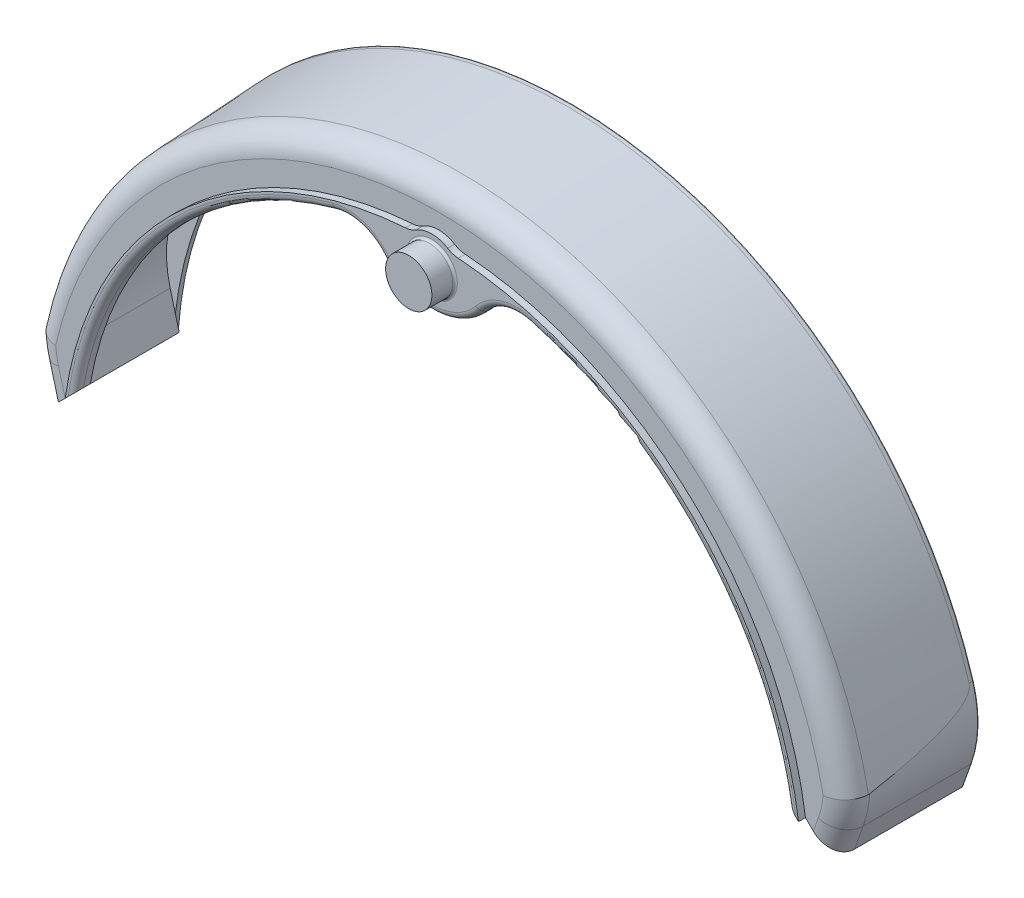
ISO-10303-21;
HEADER;
FILE_DESCRIPTION(('STEP AP214'),'2;1');
FILE_NAME('part.step','',(''),(''),'','','');
FILE_SCHEMA(('AUTOMOTIVE_DESIGN { 1 0 10303 214 1 1 1 1 }'));
ENDSEC;
DATA;
#1=APPLICATION_CONTEXT('core data for automotive mechanical design processes');
#2=APPLICATION_PROTOCOL_DEFINITION('international standard','automotive_design',2000,#1);
#3=PRODUCT_CONTEXT('',#1,'mechanical');
#4=PRODUCT('Part','Part','',(#3));
#5=PRODUCT_RELATED_PRODUCT_CATEGORY('part','',(#4));
#6=PRODUCT_DEFINITION_FORMATION('','',#4);
#7=PRODUCT_DEFINITION_CONTEXT('part definition',#1,'design');
#8=PRODUCT_DEFINITION('design','',#6,#7);
#9=PRODUCT_DEFINITION_SHAPE('','',#8);
#10=(LENGTH_UNIT() NAMED_UNIT(*) SI_UNIT(.MILLI.,.METRE.));
#11=(NAMED_UNIT(*) PLANE_ANGLE_UNIT() SI_UNIT($,.RADIAN.));
#12=(NAMED_UNIT(*) SI_UNIT($,.STERADIAN.) SOLID_ANGLE_UNIT());
#13=UNCERTAINTY_MEASURE_WITH_UNIT(LENGTH_MEASURE(1.E-05),#10,'distance_accuracy_value','');
#14=(GEOMETRIC_REPRESENTATION_CONTEXT(3) GLOBAL_UNCERTAINTY_ASSIGNED_CONTEXT((#13)) GLOBAL_UNIT_ASSIGNED_CONTEXT((#10,
#11,#12)) REPRESENTATION_CONTEXT('',''));
#15=CARTESIAN_POINT('',(0.,0.,0.));
#16=DIRECTION('',(0.,0.,1.));
#17=DIRECTION('',(1.,0.,0.));
#18=AXIS2_PLACEMENT_3D('',#15,#16,#17);
#19=CARTESIAN_POINT('',(0.,0.,58.));
#20=DIRECTION('',(0.,0.,1.));
#21=DIRECTION('',(1.,0.,0.));
#22=AXIS2_PLACEMENT_3D('',#19,#20,#21);
#23=PLANE('',#22);
#24=CARTESIAN_POINT('',(0.,150.,58.));
#25=DIRECTION('',(0.,0.,1.));
#26=DIRECTION('',(1.,0.,0.));
#27=AXIS2_PLACEMENT_3D('',#24,#25,#26);
#28=CIRCLE('',#27,11.);
#29=CARTESIAN_POINT('',(11.,150.,58.));
#30=VERTEX_POINT('',#29);
#31=EDGE_CURVE('E12',#30,#30,#28,.F.);
#32=ORIENTED_EDGE('',*,*,#31,.T.);
#33=EDGE_LOOP('',(#32));
#34=FACE_BOUND('',#33,.T.);
#35=CARTESIAN_POINT('',(36.7734417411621,130.93400621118,58.));
#36=DIRECTION('',(0.,0.,1.));
#37=DIRECTION('',(1.,0.,0.));
#38=AXIS2_PLACEMENT_3D('',#35,#36,#37);
#39=CIRCLE('',#38,23.);
#40=CARTESIAN_POINT('',(18.967354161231,145.492276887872,58.));
#41=VERTEX_POINT('',#40);
#42=CARTESIAN_POINT('',(42.9924796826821,153.0772572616,58.));
#43=VERTEX_POINT('',#42);
#44=EDGE_CURVE('E443',#41,#43,#39,.F.);
#45=ORIENTED_EDGE('',*,*,#44,.T.);
#46=CARTESIAN_POINT('',(0.,0.,58.));
#47=DIRECTION('',(0.,0.,1.));
#48=DIRECTION('',(1.,0.,0.));
#49=AXIS2_PLACEMENT_3D('',#46,#47,#48);
#50=CIRCLE('',#49,159.);
#51=CARTESIAN_POINT('',(157.259857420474,23.4592677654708,58.));
#52=VERTEX_POINT('',#51);
#53=EDGE_CURVE('E383',#43,#52,#50,.F.);
#54=ORIENTED_EDGE('',*,*,#53,.T.);
#55=DIRECTION('',(0.707106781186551,-0.707106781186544,0.));
#56=VECTOR('',#55,1.);
#57=CARTESIAN_POINT('',(153.630009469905,27.0891157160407,58.));
#58=LINE('',#57,#56);
#59=CARTESIAN_POINT('',(158.441494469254,22.2776307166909,58.));
#60=VERTEX_POINT('',#59);
#61=EDGE_CURVE('E463',#52,#60,#58,.T.);
#62=ORIENTED_EDGE('',*,*,#61,.T.);
#63=CARTESIAN_POINT('',(0.,0.,58.));
#64=DIRECTION('',(0.,0.,1.));
#65=DIRECTION('',(1.,0.,0.));
#66=AXIS2_PLACEMENT_3D('',#63,#64,#65);
#67=CIRCLE('',#66,160.);
#68=CARTESIAN_POINT('',(11.372866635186,159.595294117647,58.));
#69=VERTEX_POINT('',#68);
#70=EDGE_CURVE('E656',#60,#69,#67,.T.);
#71=ORIENTED_EDGE('',*,*,#70,.T.);
#72=CARTESIAN_POINT('',(12.0836707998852,169.57,58.));
#73=DIRECTION('',(0.,0.,-1.));
#74=DIRECTION('',(-1.,0.,0.));
#75=AXIS2_PLACEMENT_3D('',#72,#73,#74);
#76=CIRCLE('',#75,10.);
#77=CARTESIAN_POINT('',(6.82990088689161,161.061304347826,58.));
#78=VERTEX_POINT('',#77);
#79=EDGE_CURVE('E654',#69,#78,#76,.T.);
#80=ORIENTED_EDGE('',*,*,#79,.T.);
#81=CARTESIAN_POINT('',(0.,150.,58.));
#82=DIRECTION('',(0.,0.,1.));
#83=DIRECTION('',(1.,0.,0.));
#84=AXIS2_PLACEMENT_3D('',#81,#82,#83);
#85=CIRCLE('',#84,12.9999999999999);
#86=CARTESIAN_POINT('',(-6.82990088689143,161.061304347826,58.));
#87=VERTEX_POINT('',#86);
#88=EDGE_CURVE('E652',#78,#87,#85,.T.);
#89=ORIENTED_EDGE('',*,*,#88,.T.);
#90=CARTESIAN_POINT('',(-12.0836707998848,169.57,58.));
#91=DIRECTION('',(0.,0.,-1.));
#92=DIRECTION('',(-1.,0.,0.));
#93=AXIS2_PLACEMENT_3D('',#90,#91,#92);
#94=CIRCLE('',#93,9.99999999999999);
#95=CARTESIAN_POINT('',(-11.3728666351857,159.595294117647,58.));
#96=VERTEX_POINT('',#95);
#97=EDGE_CURVE('E650',#87,#96,#94,.T.);
#98=ORIENTED_EDGE('',*,*,#97,.T.);
#99=CARTESIAN_POINT('',(0.,0.,58.));
#100=DIRECTION('',(0.,0.,1.));
#101=DIRECTION('',(1.,0.,0.));
#102=AXIS2_PLACEMENT_3D('',#99,#100,#101);
#103=CIRCLE('',#102,160.);
#104=CARTESIAN_POINT('',(-158.441494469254,22.2776307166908,58.));
#105=VERTEX_POINT('',#104);
#106=EDGE_CURVE('E660',#96,#105,#103,.T.);
#107=ORIENTED_EDGE('',*,*,#106,.T.);
#108=DIRECTION('',(0.707106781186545,0.70710678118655,0.));
#109=VECTOR('',#108,1.);
#110=CARTESIAN_POINT('',(-153.630009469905,27.0891157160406,58.));
#111=LINE('',#110,#109);
#112=CARTESIAN_POINT('',(-157.259857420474,23.4592677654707,58.));
#113=VERTEX_POINT('',#112);
#114=EDGE_CURVE('E283',#105,#113,#111,.T.);
#115=ORIENTED_EDGE('',*,*,#114,.T.);
#116=CARTESIAN_POINT('',(0.,0.,58.));
#117=DIRECTION('',(0.,0.,1.));
#118=DIRECTION('',(1.,0.,0.));
#119=AXIS2_PLACEMENT_3D('',#116,#117,#118);
#120=CIRCLE('',#119,159.);
#121=CARTESIAN_POINT('',(-42.9924796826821,153.0772572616,58.));
#122=VERTEX_POINT('',#121);
#123=EDGE_CURVE('E451',#113,#122,#120,.F.);
#124=ORIENTED_EDGE('',*,*,#123,.T.);
#125=CARTESIAN_POINT('',(-36.7734417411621,130.93400621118,58.));
#126=DIRECTION('',(0.,0.,1.));
#127=DIRECTION('',(1.,0.,0.));
#128=AXIS2_PLACEMENT_3D('',#125,#126,#127);
#129=CIRCLE('',#128,23.);
#130=CARTESIAN_POINT('',(-18.967354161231,145.492276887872,58.));
#131=VERTEX_POINT('',#130);
#132=EDGE_CURVE('E1133',#122,#131,#129,.F.);
#133=ORIENTED_EDGE('',*,*,#132,.T.);
#134=CARTESIAN_POINT('',(0.,161.,58.));
#135=DIRECTION('',(0.,0.,1.));
#136=DIRECTION('',(1.,0.,0.));
#137=AXIS2_PLACEMENT_3D('',#134,#135,#136);
#138=CIRCLE('',#137,24.5);
#139=EDGE_CURVE('E448',#131,#41,#138,.T.);
#140=ORIENTED_EDGE('',*,*,#139,.T.);
#141=EDGE_LOOP('',(#45,#54,#62,#71,#80,#89,#98,#107,#115,#124,#133,#140));
#142=FACE_BOUND('',#141,.T.);
#143=ADVANCED_FACE('F32',(#34,#142),#23,.T.);
#144=CARTESIAN_POINT('',(0.,0.,55.));
#145=DIRECTION('',(0.,0.,1.));
#146=DIRECTION('',(1.,0.,0.));
#147=AXIS2_PLACEMENT_3D('',#144,#145,#146);
#148=PLANE('',#147);
#149=DIRECTION('',(0.707106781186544,0.707106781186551,0.));
#150=VECTOR('',#149,1.);
#151=CARTESIAN_POINT('',(-153.630009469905,27.0891157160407,54.99999999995));
#152=LINE('',#151,#150);
#153=CARTESIAN_POINT('',(-161.473531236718,19.2455939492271,54.99999999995));
#154=VERTEX_POINT('',#153);
#155=CARTESIAN_POINT('',(-158.441494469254,22.2776307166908,55.));
#156=VERTEX_POINT('',#155);
#157=EDGE_CURVE('E280',#154,#156,#152,.T.);
#158=ORIENTED_EDGE('',*,*,#157,.T.);
#159=CARTESIAN_POINT('',(0.,0.,55.));
#160=DIRECTION('',(0.,0.,1.));
#161=DIRECTION('',(1.,0.,0.));
#162=AXIS2_PLACEMENT_3D('',#159,#160,#161);
#163=CIRCLE('',#162,160.);
#164=CARTESIAN_POINT('',(-11.3728666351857,159.595294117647,55.));
#165=VERTEX_POINT('',#164);
#166=EDGE_CURVE('E292',#165,#156,#163,.T.);
#167=ORIENTED_EDGE('',*,*,#166,.F.);
#168=CARTESIAN_POINT('',(-12.0836707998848,169.57,55.));
#169=DIRECTION('',(0.,0.,-1.));
#170=DIRECTION('',(-1.,0.,0.));
#171=AXIS2_PLACEMENT_3D('',#168,#169,#170);
#172=CIRCLE('',#171,9.99999999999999);
#173=CARTESIAN_POINT('',(-6.82990088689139,161.061304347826,55.));
#174=VERTEX_POINT('',#173);
#175=EDGE_CURVE('E662',#174,#165,#172,.T.);
#176=ORIENTED_EDGE('',*,*,#175,.F.);
#177=CARTESIAN_POINT('',(0.,150.,55.));
#178=DIRECTION('',(0.,0.,1.));
#179=DIRECTION('',(1.,0.,0.));
#180=AXIS2_PLACEMENT_3D('',#177,#178,#179);
#181=CIRCLE('',#180,12.9999999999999);
#182=CARTESIAN_POINT('',(6.82990088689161,161.061304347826,55.));
#183=VERTEX_POINT('',#182);
#184=EDGE_CURVE('E664',#183,#174,#181,.T.);
#185=ORIENTED_EDGE('',*,*,#184,.F.);
#186=CARTESIAN_POINT('',(12.0836707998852,169.57,55.));
#187=DIRECTION('',(0.,0.,-1.));
#188=DIRECTION('',(-1.,0.,0.));
#189=AXIS2_PLACEMENT_3D('',#186,#187,#188);
#190=CIRCLE('',#189,10.);
#191=CARTESIAN_POINT('',(11.372866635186,159.595294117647,55.));
#192=VERTEX_POINT('',#191);
#193=EDGE_CURVE('E667',#192,#183,#190,.T.);
#194=ORIENTED_EDGE('',*,*,#193,.F.);
#195=CARTESIAN_POINT('',(0.,0.,55.));
#196=DIRECTION('',(0.,0.,1.));
#197=DIRECTION('',(1.,0.,0.));
#198=AXIS2_PLACEMENT_3D('',#195,#196,#197);
#199=CIRCLE('',#198,160.);
#200=CARTESIAN_POINT('',(158.441494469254,22.2776307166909,55.));
#201=VERTEX_POINT('',#200);
#202=EDGE_CURVE('E298',#201,#192,#199,.T.);
#203=ORIENTED_EDGE('',*,*,#202,.F.);
#204=DIRECTION('',(0.707106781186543,-0.707106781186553,0.));
#205=VECTOR('',#204,1.);
#206=CARTESIAN_POINT('',(153.630009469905,27.0891157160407,54.99999999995));
#207=LINE('',#206,#205);
#208=CARTESIAN_POINT('',(161.814095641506,18.9050295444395,54.99999999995));
#209=VERTEX_POINT('',#208);
#210=EDGE_CURVE('E305',#201,#209,#207,.T.);
#211=ORIENTED_EDGE('',*,*,#210,.T.);
#212=DIRECTION('',(0.336297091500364,0.941755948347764,0.));
#213=VECTOR('',#212,1.);
#214=CARTESIAN_POINT('',(137.526203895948,-49.110029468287,55.));
#215=LINE('',#214,#213);
#216=CARTESIAN_POINT('',(163.966262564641,24.9318910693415,55.));
#217=VERTEX_POINT('',#216);
#218=EDGE_CURVE('E1074',#209,#217,#215,.T.);
#219=ORIENTED_EDGE('',*,*,#218,.T.);
#220=CARTESIAN_POINT('',(126.29602463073,38.3837747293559,55.));
#221=DIRECTION('',(0.,0.,1.));
#222=DIRECTION('',(1.,0.,0.));
#223=AXIS2_PLACEMENT_3D('',#220,#221,#222);
#224=CIRCLE('',#223,40.);
#225=CARTESIAN_POINT('',(166.099117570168,34.4197121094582,55.));
#226=VERTEX_POINT('',#225);
#227=EDGE_CURVE('E1175',#217,#226,#224,.T.);
#228=ORIENTED_EDGE('',*,*,#227,.T.);
#229=CARTESIAN_POINT('',(0.,0.,55.));
#230=DIRECTION('',(0.,0.,1.));
#231=DIRECTION('',(1.,0.,0.));
#232=AXIS2_PLACEMENT_3D('',#229,#230,#231);
#233=CIRCLE('',#232,169.627926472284);
#234=CARTESIAN_POINT('',(-165.559613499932,36.9276023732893,55.));
#235=VERTEX_POINT('',#234);
#236=EDGE_CURVE('E1076',#226,#235,#233,.T.);
#237=ORIENTED_EDGE('',*,*,#236,.T.);
#238=CARTESIAN_POINT('',(-125.701125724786,40.2892912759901,55.));
#239=DIRECTION('',(0.,0.,1.));
#240=DIRECTION('',(1.,0.,0.));
#241=AXIS2_PLACEMENT_3D('',#238,#239,#240);
#242=CIRCLE('',#241,40.);
#243=CARTESIAN_POINT('',(-164.338158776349,29.9365294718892,55.));
#244=VERTEX_POINT('',#243);
#245=EDGE_CURVE('E1179',#235,#244,#242,.T.);
#246=ORIENTED_EDGE('',*,*,#245,.T.);
#247=DIRECTION('',(0.258819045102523,-0.965925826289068,0.));
#248=VECTOR('',#247,1.);
#249=CARTESIAN_POINT('',(-145.845457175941,-39.0791724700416,55.));
#250=LINE('',#249,#248);
#251=EDGE_CURVE('E303',#244,#154,#250,.T.);
#252=ORIENTED_EDGE('',*,*,#251,.T.);
#253=EDGE_LOOP('',(#158,#167,#176,#185,#194,#203,#211,#219,#228,#237,#246,#252));
#254=FACE_BOUND('',#253,.T.);
#255=ADVANCED_FACE('F301',(#254),#148,.T.);
#256=CARTESIAN_POINT('',(0.,0.,0.));
#257=DIRECTION('',(0.,0.,1.));
#258=DIRECTION('',(1.,0.,0.));
#259=AXIS2_PLACEMENT_3D('',#256,#257,#258);
#260=PLANE('',#259);
#261=CARTESIAN_POINT('',(0.,0.,0.));
#262=DIRECTION('',(0.,0.,1.));
#263=DIRECTION('',(-1.,0.,0.));
#264=AXIS2_PLACEMENT_3D('',#261,#262,#263);
#265=CIRCLE('',#264,170.);
#266=CARTESIAN_POINT('',(169.638497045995,11.0806281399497,0.));
#267=VERTEX_POINT('',#266);
#268=CARTESIAN_POINT('',(169.016531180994,18.2595779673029,0.));
#269=VERTEX_POINT('',#268);
#270=EDGE_CURVE('E625',#267,#269,#265,.T.);
#271=ORIENTED_EDGE('',*,*,#270,.F.);
#272=DIRECTION('',(0.707106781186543,-0.707106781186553,0.));
#273=VECTOR('',#272,1.);
#274=CARTESIAN_POINT('',(153.630009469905,27.0891157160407,0.));
#275=LINE('',#274,#273);
#276=CARTESIAN_POINT('',(167.291176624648,13.4279485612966,0.));
#277=VERTEX_POINT('',#276);
#278=EDGE_CURVE('E304',#277,#267,#275,.T.);
#279=ORIENTED_EDGE('',*,*,#278,.F.);
#280=DIRECTION('',(0.336297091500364,0.941755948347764,0.));
#281=VECTOR('',#280,1.);
#282=CARTESIAN_POINT('',(144.118495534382,-51.4641091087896,0.));
#283=LINE('',#282,#281);
#284=EDGE_CURVE('E509',#277,#269,#283,.T.);
#285=ORIENTED_EDGE('',*,*,#284,.T.);
#286=EDGE_LOOP('',(#271,#279,#285));
#287=FACE_BOUND('',#286,.T.);
#288=ADVANCED_FACE('F438',(#287),#260,.F.);
#289=CARTESIAN_POINT('',(-168.850913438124,19.7324360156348,0.));
#290=VERTEX_POINT('',#289);
#291=CARTESIAN_POINT('',(-169.638497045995,11.0806281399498,0.));
#292=VERTEX_POINT('',#291);
#293=EDGE_CURVE('E629',#290,#292,#265,.T.);
#294=ORIENTED_EDGE('',*,*,#293,.F.);
#295=DIRECTION('',(0.258819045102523,-0.965925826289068,0.));
#296=VECTOR('',#295,1.);
#297=CARTESIAN_POINT('',(-152.606937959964,-40.8909057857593,0.));
#298=LINE('',#297,#296);
#299=CARTESIAN_POINT('',(-167.189007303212,13.530117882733,0.));
#300=VERTEX_POINT('',#299);
#301=EDGE_CURVE('E501',#290,#300,#298,.T.);
#302=ORIENTED_EDGE('',*,*,#301,.T.);
#303=DIRECTION('',(0.707106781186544,0.707106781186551,0.));
#304=VECTOR('',#303,1.);
#305=CARTESIAN_POINT('',(-153.630009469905,27.0891157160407,0.));
#306=LINE('',#305,#304);
#307=EDGE_CURVE('E308',#292,#300,#306,.T.);
#308=ORIENTED_EDGE('',*,*,#307,.F.);
#309=EDGE_LOOP('',(#294,#302,#308));
#310=FACE_BOUND('',#309,.T.);
#311=ADVANCED_FACE('F845',(#310),#260,.F.);
#312=CARTESIAN_POINT('',(-36.7734417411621,130.93400621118,0.));
#313=DIRECTION('',(0.,0.,1.));
#314=DIRECTION('',(1.,0.,0.));
#315=AXIS2_PLACEMENT_3D('',#312,#313,#314);
#316=CYLINDRICAL_SURFACE('',#315,20.);
#317=DIRECTION('',(0.,0.,1.));
#318=VECTOR('',#317,1.);
#319=CARTESIAN_POINT('',(-21.2898873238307,143.593372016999,0.));
#320=LINE('',#319,#318);
#321=CARTESIAN_POINT('',(-21.2898873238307,143.593372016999,52.));
#322=VERTEX_POINT('',#321);
#323=CARTESIAN_POINT('',(-21.2898873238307,143.593372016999,55.));
#324=VERTEX_POINT('',#323);
#325=EDGE_CURVE('E316',#322,#324,#320,.T.);
#326=ORIENTED_EDGE('',*,*,#325,.T.);
#327=CARTESIAN_POINT('',(-36.7734417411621,130.93400621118,55.));
#328=DIRECTION('',(0.,0.,1.));
#329=DIRECTION('',(1.,0.,0.));
#330=AXIS2_PLACEMENT_3D('',#327,#328,#329);
#331=CIRCLE('',#330,20.);
#332=CARTESIAN_POINT('',(-42.1813008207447,150.189007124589,55.));
#333=VERTEX_POINT('',#332);
#334=EDGE_CURVE('E55',#324,#333,#331,.T.);
#335=ORIENTED_EDGE('',*,*,#334,.T.);
#336=DIRECTION('',(0.,0.,1.));
#337=VECTOR('',#336,1.);
#338=CARTESIAN_POINT('',(-42.1813008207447,150.189007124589,0.));
#339=LINE('',#338,#337);
#340=CARTESIAN_POINT('',(-42.1813008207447,150.189007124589,52.));
#341=VERTEX_POINT('',#340);
#342=EDGE_CURVE('E317',#341,#333,#339,.T.);
#343=ORIENTED_EDGE('',*,*,#342,.F.);
#344=CARTESIAN_POINT('',(-36.7734417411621,130.93400621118,52.));
#345=DIRECTION('',(0.,0.,1.));
#346=DIRECTION('',(1.,0.,0.));
#347=AXIS2_PLACEMENT_3D('',#344,#345,#346);
#348=CIRCLE('',#347,20.);
#349=EDGE_CURVE('E481',#341,#322,#348,.F.);
#350=ORIENTED_EDGE('',*,*,#349,.T.);
#351=EDGE_LOOP('',(#326,#335,#343,#350));
#352=FACE_BOUND('',#351,.T.);
#353=ADVANCED_FACE('F835',(#352),#316,.F.);
#354=CARTESIAN_POINT('',(0.,0.,0.));
#355=DIRECTION('',(0.,0.,1.));
#356=DIRECTION('',(1.,0.,0.));
#357=AXIS2_PLACEMENT_3D('',#354,#355,#356);
#358=CYLINDRICAL_SURFACE('',#357,156.);
#359=ORIENTED_EDGE('',*,*,#342,.T.);
#360=CARTESIAN_POINT('',(0.,0.,55.));
#361=DIRECTION('',(0.,0.,1.));
#362=DIRECTION('',(1.,0.,0.));
#363=AXIS2_PLACEMENT_3D('',#360,#361,#362);
#364=CIRCLE('',#363,156.);
#365=CARTESIAN_POINT('',(-153.630009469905,27.0891157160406,55.));
#366=VERTEX_POINT('',#365);
#367=EDGE_CURVE('E421',#333,#366,#364,.T.);
#368=ORIENTED_EDGE('',*,*,#367,.T.);
#369=DIRECTION('',(0.,0.,1.));
#370=VECTOR('',#369,1.);
#371=CARTESIAN_POINT('',(-153.630009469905,27.0891157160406,0.));
#372=LINE('',#371,#370);
#373=CARTESIAN_POINT('',(-153.630009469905,27.0891157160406,52.));
#374=VERTEX_POINT('',#373);
#375=EDGE_CURVE('E320',#374,#366,#372,.T.);
#376=ORIENTED_EDGE('',*,*,#375,.F.);
#377=CARTESIAN_POINT('',(0.,0.,52.));
#378=DIRECTION('',(0.,0.,1.));
#379=DIRECTION('',(1.,0.,0.));
#380=AXIS2_PLACEMENT_3D('',#377,#378,#379);
#381=CIRCLE('',#380,156.);
#382=EDGE_CURVE('E485',#374,#341,#381,.F.);
#383=ORIENTED_EDGE('',*,*,#382,.T.);
#384=EDGE_LOOP('',(#359,#368,#376,#383));
#385=FACE_BOUND('',#384,.T.);
#386=ADVANCED_FACE('F426',(#385),#358,.F.);
#387=CARTESIAN_POINT('',(-153.630009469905,27.0891157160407,0.));
#388=DIRECTION('',(0.707106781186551,-0.707106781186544,0.));
#389=DIRECTION('',(0.707106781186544,0.707106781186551,0.));
#390=AXIS2_PLACEMENT_3D('',#387,#388,#389);
#391=PLANE('',#390);
#392=ORIENTED_EDGE('',*,*,#375,.T.);
#393=CARTESIAN_POINT('',(-153.630009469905,27.0891157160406,55.));
#394=CARTESIAN_POINT('',(-153.629984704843,27.0891404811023,55.0605763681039));
#395=CARTESIAN_POINT('',(-153.63227038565,27.0868548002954,55.1211313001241));
#396=CARTESIAN_POINT('',(-153.641269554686,27.0778556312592,55.2414935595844));
#397=CARTESIAN_POINT('',(-153.647976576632,27.0711486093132,55.301301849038));
#398=CARTESIAN_POINT('',(-153.665511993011,27.0536131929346,55.4188795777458));
#399=CARTESIAN_POINT('',(-153.676285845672,27.0428393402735,55.4766653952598));
#400=CARTESIAN_POINT('',(-153.701641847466,27.0174833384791,55.5905361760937));
#401=CARTESIAN_POINT('',(-153.716225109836,27.0029000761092,55.646620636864));
#402=CARTESIAN_POINT('',(-153.764963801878,26.9541613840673,55.8111111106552));
#403=CARTESIAN_POINT('',(-153.804233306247,26.9148918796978,55.9165411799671));
#404=CARTESIAN_POINT('',(-153.893539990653,26.8255851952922,56.1180653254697));
#405=CARTESIAN_POINT('',(-153.943615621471,26.775509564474,56.2141242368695));
#406=CARTESIAN_POINT('',(-154.084074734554,26.6350504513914,56.4508170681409));
#407=CARTESIAN_POINT('',(-154.180721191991,26.5384039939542,56.5839941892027));
#408=CARTESIAN_POINT('',(-154.387153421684,26.3319717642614,56.8279396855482));
#409=CARTESIAN_POINT('',(-154.496968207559,26.2221569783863,56.9386570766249));
#410=CARTESIAN_POINT('',(-154.705456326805,26.0136688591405,57.1229489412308));
#411=CARTESIAN_POINT('',(-154.802779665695,25.9163455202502,57.1996358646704));
#412=CARTESIAN_POINT('',(-155.001763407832,25.717361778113,57.3409284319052));
#413=CARTESIAN_POINT('',(-155.103426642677,25.6156985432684,57.4055260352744));
#414=CARTESIAN_POINT('',(-155.310156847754,25.4089683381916,57.5238271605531));
#415=CARTESIAN_POINT('',(-155.41523205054,25.3038931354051,57.5775016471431));
#416=CARTESIAN_POINT('',(-155.627731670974,25.0913935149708,57.6745911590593));
#417=CARTESIAN_POINT('',(-155.735156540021,24.983968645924,57.7180041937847));
#418=CARTESIAN_POINT('',(-155.959658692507,24.7594664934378,57.7980083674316));
#419=CARTESIAN_POINT('',(-156.076866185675,24.6422590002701,57.833865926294));
#420=CARTESIAN_POINT('',(-156.312665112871,24.4064600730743,57.8949918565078));
#421=CARTESIAN_POINT('',(-156.431256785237,24.2878684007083,57.9202583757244));
#422=CARTESIAN_POINT('',(-156.668012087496,24.051113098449,57.960304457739));
#423=CARTESIAN_POINT('',(-156.786166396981,23.9329587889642,57.9751948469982));
#424=CARTESIAN_POINT('',(-157.022834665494,23.6962905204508,57.9950258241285));
#425=CARTESIAN_POINT('',(-157.141348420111,23.5777767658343,57.9999712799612));
#426=CARTESIAN_POINT('',(-157.259857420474,23.4592677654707,58.));
#427=B_SPLINE_CURVE_WITH_KNOTS('',3,(#393,#394,#395,#396,#397,#398,#399,#400,#401,#402,#403,
#404,#405,#406,#407,#408,#409,#410,#411,#412,#413,#414,#415,#416,#417,#418,#419,#420,#421,#422,
#423,#424,#425,#426),.UNSPECIFIED.,.F.,.F.,(4,2,2,2,2,2,2,2,2,2,2,2,2,2,2,2,4),(0.,
0.181608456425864,0.362951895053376,0.541945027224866,0.720990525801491,1.07669740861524,
1.43369148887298,2.0029519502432,2.57349053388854,3.0455212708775,3.51786484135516,
3.99144802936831,4.46512301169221,4.97352848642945,5.48202283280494,5.98499912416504,
6.48772915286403),.UNSPECIFIED.);
#428=EDGE_CURVE('E414',#366,#113,#427,.T.);
#429=ORIENTED_EDGE('',*,*,#428,.T.);
#430=ORIENTED_EDGE('',*,*,#114,.F.);
#431=DIRECTION('',(0.,0.,-1.));
#432=VECTOR('',#431,1.);
#433=CARTESIAN_POINT('',(-158.441494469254,22.2776307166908,58.));
#434=LINE('',#433,#432);
#435=EDGE_CURVE('E275',#105,#156,#434,.T.);
#436=ORIENTED_EDGE('',*,*,#435,.T.);
#437=ORIENTED_EDGE('',*,*,#157,.F.);
#438=CARTESIAN_POINT('',(-161.473531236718,19.2455939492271,45.));
#439=DIRECTION('',(0.707106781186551,-0.707106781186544,0.));
#440=DIRECTION('',(-0.707106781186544,-0.707106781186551,0.));
#441=AXIS2_PLACEMENT_3D('',#438,#439,#440);
#442=ELLIPSE('',#441,11.5470053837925,10.);
#443=CARTESIAN_POINT('',(-169.638497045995,11.0806281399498,45.));
#444=VERTEX_POINT('',#443);
#445=EDGE_CURVE('E1094',#154,#444,#442,.T.);
#446=ORIENTED_EDGE('',*,*,#445,.T.);
#447=DIRECTION('',(0.,0.,1.));
#448=VECTOR('',#447,1.);
#449=CARTESIAN_POINT('',(-169.638497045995,11.0806281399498,0.));
#450=LINE('',#449,#448);
#451=EDGE_CURVE('E322',#292,#444,#450,.T.);
#452=ORIENTED_EDGE('',*,*,#451,.F.);
#453=ORIENTED_EDGE('',*,*,#307,.T.);
#454=DIRECTION('',(0.,0.,1.));
#455=VECTOR('',#454,1.);
#456=CARTESIAN_POINT('',(-167.189007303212,13.530117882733,0.));
#457=LINE('',#456,#455);
#458=CARTESIAN_POINT('',(-167.189007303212,13.530117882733,52.));
#459=VERTEX_POINT('',#458);
#460=EDGE_CURVE('E493',#300,#459,#457,.T.);
#461=ORIENTED_EDGE('',*,*,#460,.T.);
#462=DIRECTION('',(0.707106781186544,0.707106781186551,0.));
#463=VECTOR('',#462,1.);
#464=CARTESIAN_POINT('',(-90.3595625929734,90.3595625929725,52.));
#465=LINE('',#464,#463);
#466=EDGE_CURVE('E489',#459,#374,#465,.T.);
#467=ORIENTED_EDGE('',*,*,#466,.T.);
#468=EDGE_LOOP('',(#392,#429,#430,#436,#437,#446,#452,#453,#461,#467));
#469=FACE_BOUND('',#468,.T.);
#470=ADVANCED_FACE('F278',(#469),#391,.T.);
#471=CARTESIAN_POINT('',(153.630009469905,27.0891157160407,0.));
#472=DIRECTION('',(-0.707106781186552,-0.707106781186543,0.));
#473=DIRECTION('',(0.707106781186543,-0.707106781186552,0.));
#474=AXIS2_PLACEMENT_3D('',#471,#472,#473);
#475=PLANE('',#474);
#476=ORIENTED_EDGE('',*,*,#61,.F.);
#477=CARTESIAN_POINT('',(157.259857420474,23.4592677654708,58.));
#478=CARTESIAN_POINT('',(157.17728700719,23.5418381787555,57.9999939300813));
#479=CARTESIAN_POINT('',(157.094727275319,23.6243979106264,57.9975864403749));
#480=CARTESIAN_POINT('',(156.929741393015,23.7893837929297,57.9879569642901));
#481=CARTESIAN_POINT('',(156.847315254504,23.8718099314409,57.9807345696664));
#482=CARTESIAN_POINT('',(156.599997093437,24.1191280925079,57.9517778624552));
#483=CARTESIAN_POINT('',(156.435497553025,24.2836276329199,57.9227538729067));
#484=CARTESIAN_POINT('',(156.107185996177,24.6119391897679,57.8442734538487));
#485=CARTESIAN_POINT('',(155.943399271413,24.7757259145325,57.7946059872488));
#486=CARTESIAN_POINT('',(155.620038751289,25.0990864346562,57.6734667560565));
#487=CARTESIAN_POINT('',(155.460459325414,25.2586658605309,57.6020259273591));
#488=CARTESIAN_POINT('',(155.232274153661,25.4868510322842,57.4801160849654));
#489=CARTESIAN_POINT('',(155.161090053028,25.5580351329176,57.4391641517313));
#490=CARTESIAN_POINT('',(155.020402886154,25.6987222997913,57.3518114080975));
#491=CARTESIAN_POINT('',(154.950899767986,25.7682254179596,57.3054107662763));
#492=CARTESIAN_POINT('',(154.81408309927,25.9050420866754,57.2068623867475));
#493=CARTESIAN_POINT('',(154.746766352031,25.9723588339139,57.1547235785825));
#494=CARTESIAN_POINT('',(154.614755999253,26.1043691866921,57.0442130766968));
#495=CARTESIAN_POINT('',(154.550061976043,26.169063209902,56.9858423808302));
#496=CARTESIAN_POINT('',(154.384022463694,26.3351027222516,56.8232918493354));
#497=CARTESIAN_POINT('',(154.285364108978,26.4337610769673,56.7134818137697));
#498=CARTESIAN_POINT('',(154.101101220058,26.6180239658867,56.4736025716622));
#499=CARTESIAN_POINT('',(154.015473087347,26.7036520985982,56.343570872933));
#500=CARTESIAN_POINT('',(153.889885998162,26.8292391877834,56.1100361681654));
#501=CARTESIAN_POINT('',(153.844309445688,26.8748157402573,56.0126005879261));
#502=CARTESIAN_POINT('',(153.764511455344,26.9546137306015,55.8089774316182));
#503=CARTESIAN_POINT('',(153.730252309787,26.9888728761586,55.7028204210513));
#504=CARTESIAN_POINT('',(153.691246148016,27.027879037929,55.5459027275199));
#505=CARTESIAN_POINT('',(153.680785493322,27.0383396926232,55.4979009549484));
#506=CARTESIAN_POINT('',(153.662668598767,27.0564565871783,55.4008469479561));
#507=CARTESIAN_POINT('',(153.655011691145,27.0641134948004,55.3517949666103));
#508=CARTESIAN_POINT('',(153.642615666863,27.0765095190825,55.252508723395));
#509=CARTESIAN_POINT('',(153.637903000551,27.0812221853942,55.2022678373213));
#510=CARTESIAN_POINT('',(153.631592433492,27.0875327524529,55.101354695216));
#511=CARTESIAN_POINT('',(153.629997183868,27.089128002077,55.0506821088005));
#512=CARTESIAN_POINT('',(153.630009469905,27.0891157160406,55.));
#513=B_SPLINE_CURVE_WITH_KNOTS('',3,(#477,#478,#479,#480,#481,#482,#483,#484,#485,#486,#487,
#488,#489,#490,#491,#492,#493,#494,#495,#496,#497,#498,#499,#500,#501,#502,#503,#504,#505,#506,
#507,#508,#509,#510,#511,#512),.UNSPECIFIED.,.F.,.F.,(4,2,2,2,2,2,2,2,2,2,2,2,2,2,2,2,2,4),(0.,
0.350261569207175,0.700552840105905,1.40296358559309,2.11273888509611,2.82151039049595,
3.14742275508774,3.47332503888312,3.79872715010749,4.12407723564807,4.6551243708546,
5.18519799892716,5.53457201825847,5.88276995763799,6.03332386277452,6.18384188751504,
6.33569338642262,6.4876739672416),.UNSPECIFIED.);
#514=CARTESIAN_POINT('',(153.630009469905,27.0891157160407,55.));
#515=VERTEX_POINT('',#514);
#516=EDGE_CURVE('E375',#52,#515,#513,.T.);
#517=ORIENTED_EDGE('',*,*,#516,.T.);
#518=DIRECTION('',(0.,0.,1.));
#519=VECTOR('',#518,1.);
#520=CARTESIAN_POINT('',(153.630009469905,27.0891157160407,0.));
#521=LINE('',#520,#519);
#522=CARTESIAN_POINT('',(153.630009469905,27.0891157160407,52.));
#523=VERTEX_POINT('',#522);
#524=EDGE_CURVE('E332',#523,#515,#521,.T.);
#525=ORIENTED_EDGE('',*,*,#524,.F.);
#526=DIRECTION('',(0.707106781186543,-0.707106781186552,0.));
#527=VECTOR('',#526,1.);
#528=CARTESIAN_POINT('',(90.3595625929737,90.3595625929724,52.));
#529=LINE('',#528,#527);
#530=CARTESIAN_POINT('',(167.291176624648,13.4279485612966,52.));
#531=VERTEX_POINT('',#530);
#532=EDGE_CURVE('E470',#523,#531,#529,.T.);
#533=ORIENTED_EDGE('',*,*,#532,.T.);
#534=DIRECTION('',(0.,0.,1.));
#535=VECTOR('',#534,1.);
#536=CARTESIAN_POINT('',(167.291176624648,13.4279485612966,0.));
#537=LINE('',#536,#535);
#538=EDGE_CURVE('E500',#277,#531,#537,.T.);
#539=ORIENTED_EDGE('',*,*,#538,.F.);
#540=ORIENTED_EDGE('',*,*,#278,.T.);
#541=DIRECTION('',(0.,0.,1.));
#542=VECTOR('',#541,1.);
#543=CARTESIAN_POINT('',(169.638497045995,11.0806281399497,0.));
#544=LINE('',#543,#542);
#545=CARTESIAN_POINT('',(169.638497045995,11.0806281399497,45.));
#546=VERTEX_POINT('',#545);
#547=EDGE_CURVE('E329',#267,#546,#544,.T.);
#548=ORIENTED_EDGE('',*,*,#547,.T.);
#549=CARTESIAN_POINT('',(161.814095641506,18.9050295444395,45.));
#550=DIRECTION('',(-0.707106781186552,-0.707106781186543,0.));
#551=DIRECTION('',(-0.707106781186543,0.707106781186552,0.));
#552=AXIS2_PLACEMENT_3D('',#549,#550,#551);
#553=ELLIPSE('',#552,11.0653745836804,10.);
#554=EDGE_CURVE('E1089',#546,#209,#553,.T.);
#555=ORIENTED_EDGE('',*,*,#554,.T.);
#556=ORIENTED_EDGE('',*,*,#210,.F.);
#557=DIRECTION('',(0.,0.,-1.));
#558=VECTOR('',#557,1.);
#559=CARTESIAN_POINT('',(158.441494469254,22.2776307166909,58.));
#560=LINE('',#559,#558);
#561=EDGE_CURVE('E288',#60,#201,#560,.T.);
#562=ORIENTED_EDGE('',*,*,#561,.F.);
#563=EDGE_LOOP('',(#476,#517,#525,#533,#539,#540,#548,#555,#556,#562));
#564=FACE_BOUND('',#563,.T.);
#565=ADVANCED_FACE('F367',(#564),#475,.T.);
#566=CARTESIAN_POINT('',(0.,0.,0.));
#567=DIRECTION('',(0.,0.,1.));
#568=DIRECTION('',(1.,0.,0.));
#569=AXIS2_PLACEMENT_3D('',#566,#567,#568);
#570=CYLINDRICAL_SURFACE('',#569,156.);
#571=ORIENTED_EDGE('',*,*,#524,.T.);
#572=CARTESIAN_POINT('',(0.,0.,55.));
#573=DIRECTION('',(0.,0.,1.));
#574=DIRECTION('',(1.,0.,0.));
#575=AXIS2_PLACEMENT_3D('',#572,#573,#574);
#576=CIRCLE('',#575,156.);
#577=CARTESIAN_POINT('',(42.1813008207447,150.189007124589,55.));
#578=VERTEX_POINT('',#577);
#579=EDGE_CURVE('E382',#515,#578,#576,.T.);
#580=ORIENTED_EDGE('',*,*,#579,.T.);
#581=DIRECTION('',(0.,0.,1.));
#582=VECTOR('',#581,1.);
#583=CARTESIAN_POINT('',(42.1813008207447,150.189007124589,0.));
#584=LINE('',#583,#582);
#585=CARTESIAN_POINT('',(42.1813008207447,150.189007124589,52.));
#586=VERTEX_POINT('',#585);
#587=EDGE_CURVE('E335',#586,#578,#584,.T.);
#588=ORIENTED_EDGE('',*,*,#587,.F.);
#589=CARTESIAN_POINT('',(0.,0.,52.));
#590=DIRECTION('',(0.,0.,1.));
#591=DIRECTION('',(1.,0.,0.));
#592=AXIS2_PLACEMENT_3D('',#589,#590,#591);
#593=CIRCLE('',#592,156.);
#594=EDGE_CURVE('E467',#586,#523,#593,.F.);
#595=ORIENTED_EDGE('',*,*,#594,.T.);
#596=EDGE_LOOP('',(#571,#580,#588,#595));
#597=FACE_BOUND('',#596,.T.);
#598=ADVANCED_FACE('F371',(#597),#570,.F.);
#599=CARTESIAN_POINT('',(36.7734417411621,130.93400621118,0.));
#600=DIRECTION('',(0.,0.,1.));
#601=DIRECTION('',(1.,0.,0.));
#602=AXIS2_PLACEMENT_3D('',#599,#600,#601);
#603=CYLINDRICAL_SURFACE('',#602,20.);
#604=ORIENTED_EDGE('',*,*,#587,.T.);
#605=CARTESIAN_POINT('',(36.7734417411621,130.93400621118,55.));
#606=DIRECTION('',(0.,0.,1.));
#607=DIRECTION('',(1.,0.,0.));
#608=AXIS2_PLACEMENT_3D('',#605,#606,#607);
#609=CIRCLE('',#608,20.);
#610=CARTESIAN_POINT('',(21.2898873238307,143.593372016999,55.));
#611=VERTEX_POINT('',#610);
#612=EDGE_CURVE('E455',#578,#611,#609,.T.);
#613=ORIENTED_EDGE('',*,*,#612,.T.);
#614=DIRECTION('',(0.,0.,1.));
#615=VECTOR('',#614,1.);
#616=CARTESIAN_POINT('',(21.2898873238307,143.593372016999,0.));
#617=LINE('',#616,#615);
#618=CARTESIAN_POINT('',(21.2898873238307,143.593372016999,52.));
#619=VERTEX_POINT('',#618);
#620=EDGE_CURVE('E338',#619,#611,#617,.T.);
#621=ORIENTED_EDGE('',*,*,#620,.F.);
#622=CARTESIAN_POINT('',(36.7734417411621,130.93400621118,52.));
#623=DIRECTION('',(0.,0.,1.));
#624=DIRECTION('',(1.,0.,0.));
#625=AXIS2_PLACEMENT_3D('',#622,#623,#624);
#626=CIRCLE('',#625,20.);
#627=EDGE_CURVE('E471',#619,#586,#626,.F.);
#628=ORIENTED_EDGE('',*,*,#627,.T.);
#629=EDGE_LOOP('',(#604,#613,#621,#628));
#630=FACE_BOUND('',#629,.T.);
#631=ADVANCED_FACE('F788',(#630),#603,.F.);
#632=CARTESIAN_POINT('',(0.,161.,0.));
#633=DIRECTION('',(0.,0.,1.));
#634=DIRECTION('',(1.,0.,0.));
#635=AXIS2_PLACEMENT_3D('',#632,#633,#634);
#636=CYLINDRICAL_SURFACE('',#635,27.5);
#637=ORIENTED_EDGE('',*,*,#620,.T.);
#638=CARTESIAN_POINT('',(0.,161.,55.));
#639=DIRECTION('',(0.,0.,1.));
#640=DIRECTION('',(1.,0.,0.));
#641=AXIS2_PLACEMENT_3D('',#638,#639,#640);
#642=CIRCLE('',#641,27.5);
#643=EDGE_CURVE('E48',#611,#324,#642,.F.);
#644=ORIENTED_EDGE('',*,*,#643,.T.);
#645=ORIENTED_EDGE('',*,*,#325,.F.);
#646=CARTESIAN_POINT('',(0.,161.,52.));
#647=DIRECTION('',(0.,0.,1.));
#648=DIRECTION('',(1.,0.,0.));
#649=AXIS2_PLACEMENT_3D('',#646,#647,#648);
#650=CIRCLE('',#649,27.5);
#651=EDGE_CURVE('E475',#322,#619,#650,.T.);
#652=ORIENTED_EDGE('',*,*,#651,.T.);
#653=EDGE_LOOP('',(#637,#644,#645,#652));
#654=FACE_BOUND('',#653,.T.);
#655=ADVANCED_FACE('F782',(#654),#636,.T.);
#656=CARTESIAN_POINT('',(0.,0.,0.));
#657=DIRECTION('',(0.,0.,-1.));
#658=DIRECTION('',(1.,0.,0.));
#659=AXIS2_PLACEMENT_3D('',#656,#657,#658);
#660=CONICAL_SURFACE('',#659,182.,0.05235987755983);
#661=CARTESIAN_POINT('',(0.,0.,45.5233595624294));
#662=DIRECTION('',(0.,0.,-1.));
#663=DIRECTION('',(-1.,0.,0.));
#664=AXIS2_PLACEMENT_3D('',#661,#662,#663);
#665=CIRCLE('',#664,179.61422181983);
#666=CARTESIAN_POINT('',(-175.618913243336,37.673146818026,45.5233595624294));
#667=VERTEX_POINT('',#666);
#668=CARTESIAN_POINT('',(176.168541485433,35.0130500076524,45.5233595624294));
#669=VERTEX_POINT('',#668);
#670=EDGE_CURVE('E591',#667,#669,#665,.T.);
#671=ORIENTED_EDGE('',*,*,#670,.T.);
#672=CARTESIAN_POINT('',(176.168541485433,35.0130500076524,45.5233595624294));
#673=CARTESIAN_POINT('',(176.173171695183,35.0134274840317,45.4353174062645));
#674=CARTESIAN_POINT('',(176.176930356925,35.0180754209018,45.3476830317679));
#675=CARTESIAN_POINT('',(176.182704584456,35.0359122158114,45.1732298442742));
#676=CARTESIAN_POINT('',(176.184720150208,35.0491010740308,45.0864110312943));
#677=CARTESIAN_POINT('',(176.185864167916,35.0665603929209,45.));
#678=B_SPLINE_CURVE_WITH_KNOTS('',3,(#672,#673,#674,#675,#676,#677),.UNSPECIFIED.,.F.,.F.,(4,2,
4),(0.,0.263514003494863,0.52702801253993),.UNSPECIFIED.);
#679=CARTESIAN_POINT('',(176.185864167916,35.0665603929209,45.));
#680=VERTEX_POINT('',#679);
#681=EDGE_CURVE('E590',#669,#680,#678,.T.);
#682=ORIENTED_EDGE('',*,*,#681,.T.);
#683=CARTESIAN_POINT('',(174.135367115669,52.9232833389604,6.04759297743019E-09));
#684=CARTESIAN_POINT('',(174.167731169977,52.8168062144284,-4.79140218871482E-05));
#685=CARTESIAN_POINT('',(174.199715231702,52.7102801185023,0.00513265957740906));
#686=CARTESIAN_POINT('',(174.262673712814,52.4980493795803,0.0255569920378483));
#687=CARTESIAN_POINT('',(174.293649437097,52.3923438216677,0.0407871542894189));
#688=CARTESIAN_POINT('',(174.384014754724,52.0801839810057,0.100452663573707));
#689=CARTESIAN_POINT('',(174.441709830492,51.8758270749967,0.158885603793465));
#690=CARTESIAN_POINT('',(174.569191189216,51.4135916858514,0.331041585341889));
#691=CARTESIAN_POINT('',(174.636901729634,51.1596274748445,0.456500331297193));
#692=CARTESIAN_POINT('',(174.763198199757,50.6718668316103,0.747103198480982));
#693=CARTESIAN_POINT('',(174.821728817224,50.4381961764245,0.912473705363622));
#694=CARTESIAN_POINT('',(174.926083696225,50.009683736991,1.25523652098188));
#695=CARTESIAN_POINT('',(174.972561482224,49.8132290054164,1.43046338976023));
#696=CARTESIAN_POINT('',(175.059857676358,49.4348523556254,1.7974070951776));
#697=CARTESIAN_POINT('',(175.100670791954,49.2529440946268,1.98913908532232));
#698=CARTESIAN_POINT('',(175.177643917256,48.901366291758,2.3850056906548));
#699=CARTESIAN_POINT('',(175.213794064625,48.7317230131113,2.58916529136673));
#700=CARTESIAN_POINT('',(175.282113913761,48.4033115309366,3.00647117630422));
#701=CARTESIAN_POINT('',(175.314285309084,48.2445387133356,3.21961358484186));
#702=CARTESIAN_POINT('',(175.397020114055,47.8264895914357,3.80701598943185));
#703=CARTESIAN_POINT('',(175.444384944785,47.5760731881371,4.18802041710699));
#704=CARTESIAN_POINT('',(175.531718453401,47.0961653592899,4.96390444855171));
#705=CARTESIAN_POINT('',(175.57168248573,46.8666871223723,5.35879258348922));
#706=CARTESIAN_POINT('',(175.645818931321,46.4241848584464,6.15919681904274));
#707=CARTESIAN_POINT('',(175.679979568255,46.2111947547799,6.56473264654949));
#708=CARTESIAN_POINT('',(175.743535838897,45.7991005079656,7.38317764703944));
#709=CARTESIAN_POINT('',(175.772930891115,45.5999980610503,7.79608771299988));
#710=CARTESIAN_POINT('',(175.828056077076,45.2114204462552,8.63186605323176));
#711=CARTESIAN_POINT('',(175.853745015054,45.0220666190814,9.05479320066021));
#712=CARTESIAN_POINT('',(175.901729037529,44.6534332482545,9.90521343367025));
#713=CARTESIAN_POINT('',(175.924023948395,44.4741542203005,10.3327067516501));
#714=CARTESIAN_POINT('',(175.96568008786,44.1245302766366,11.1907545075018));
#715=CARTESIAN_POINT('',(175.985045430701,43.9541730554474,11.6213037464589));
#716=CARTESIAN_POINT('',(176.021261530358,43.6210295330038,12.4854027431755));
#717=CARTESIAN_POINT('',(176.038112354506,43.4582430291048,12.9189524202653));
#718=CARTESIAN_POINT('',(176.085560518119,42.9779420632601,14.2285561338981));
#719=CARTESIAN_POINT('',(176.112813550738,42.6705435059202,15.108447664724));
#720=CARTESIAN_POINT('',(176.160315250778,42.0771301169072,16.8756324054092));
#721=CARTESIAN_POINT('',(176.180563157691,41.7911176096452,17.7629264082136));
#722=CARTESIAN_POINT('',(176.215344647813,41.2366091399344,19.5434042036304));
#723=CARTESIAN_POINT('',(176.229876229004,40.9681193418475,20.4365899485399));
#724=CARTESIAN_POINT('',(176.254164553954,40.4459374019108,22.2273562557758));
#725=CARTESIAN_POINT('',(176.263921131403,40.1922457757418,23.1249369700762));
#726=CARTESIAN_POINT('',(176.279393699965,39.6969236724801,24.9258017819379));
#727=CARTESIAN_POINT('',(176.28509977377,39.4553241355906,25.8290944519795));
#728=CARTESIAN_POINT('',(176.292988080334,38.9831791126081,27.6385849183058));
#729=CARTESIAN_POINT('',(176.29517025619,38.7526338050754,28.544782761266));
#730=CARTESIAN_POINT('',(176.297118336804,38.0756052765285,31.2665758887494));
#731=CARTESIAN_POINT('',(176.292288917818,37.6436165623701,33.0857865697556));
#732=CARTESIAN_POINT('',(176.273803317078,36.8453245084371,36.5781547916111));
#733=CARTESIAN_POINT('',(176.260921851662,36.4765511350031,38.2507578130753));
#734=CARTESIAN_POINT('',(176.228449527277,35.7605420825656,41.6006082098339));
#735=CARTESIAN_POINT('',(176.208858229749,35.4133078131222,43.2778558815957));
#736=CARTESIAN_POINT('',(176.164131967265,34.7388182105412,46.6277319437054));
#737=CARTESIAN_POINT('',(176.139024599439,34.4114734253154,48.3003427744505));
#738=CARTESIAN_POINT('',(176.083967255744,33.772645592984,51.6483150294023));
#739=CARTESIAN_POINT('',(176.05401783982,33.4611607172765,53.3236761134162));
#740=CARTESIAN_POINT('',(176.0220221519,33.156426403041,55.00019999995));
#741=B_SPLINE_CURVE_WITH_KNOTS('',3,(#683,#684,#685,#686,#687,#688,#689,#690,#691,#692,#693,
#694,#695,#696,#697,#698,#699,#700,#701,#702,#703,#704,#705,#706,#707,#708,#709,#710,#711,#712,
#713,#714,#715,#716,#717,#718,#719,#720,#721,#722,#723,#724,#725,#726,#727,#728,#729,#730,#731,
#732,#733,#734,#735,#736,#737,#738,#739,#740),.UNSPECIFIED.,.F.,.F.,(4,2,2,2,2,2,2,2,2,2,2,2,2,
2,2,2,2,2,2,2,2,2,2,2,2,2,2,2,4),(0.,0.333624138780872,0.666797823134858,1.32431249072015,
2.19320689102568,3.06715067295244,3.86793037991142,4.66945329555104,5.47264459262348,
6.27549282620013,7.64951771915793,9.02440219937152,10.4020441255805,11.7798540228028,
13.1719613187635,14.5641398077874,15.9543446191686,17.3445121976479,20.1414002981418,
22.9385919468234,25.7367623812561,28.5350302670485,31.3401260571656,34.1452671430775,
39.7542570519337,44.892562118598,50.0312030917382,55.144698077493,60.2576021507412),.UNSPECIFIED.);
#742=CARTESIAN_POINT('',(174.135427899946,52.9230833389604,0.));
#743=VERTEX_POINT('',#742);
#744=EDGE_CURVE('E319',#743,#680,#741,.T.);
#745=ORIENTED_EDGE('',*,*,#744,.F.);
#746=CARTESIAN_POINT('',(0.,0.,0.));
#747=DIRECTION('',(0.,0.,1.));
#748=DIRECTION('',(1.,0.,0.));
#749=AXIS2_PLACEMENT_3D('',#746,#747,#748);
#750=CIRCLE('',#749,182.);
#751=CARTESIAN_POINT('',(-173.315188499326,55.5503864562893,0.));
#752=VERTEX_POINT('',#751);
#753=EDGE_CURVE('E1181',#743,#752,#750,.T.);
#754=ORIENTED_EDGE('',*,*,#753,.T.);
#755=CARTESIAN_POINT('',(-175.500487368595,35.8145197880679,55.00019999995));
#756=CARTESIAN_POINT('',(-175.51651930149,35.9929654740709,54.0196383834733));
#757=CARTESIAN_POINT('',(-175.531800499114,36.173754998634,53.0394920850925));
#758=CARTESIAN_POINT('',(-175.560726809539,36.540420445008,51.0801189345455));
#759=CARTESIAN_POINT('',(-175.574371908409,36.7262964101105,50.1008920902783));
#760=CARTESIAN_POINT('',(-175.612665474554,37.292365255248,47.1636187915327));
#761=CARTESIAN_POINT('',(-175.634653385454,37.6807939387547,45.2071121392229));
#762=CARTESIAN_POINT('',(-175.670471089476,38.4914270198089,41.2618408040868));
#763=CARTESIAN_POINT('',(-175.684136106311,38.9141367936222,39.2731781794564));
#764=CARTESIAN_POINT('',(-175.700590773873,39.7923864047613,35.3039951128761));
#765=CARTESIAN_POINT('',(-175.703385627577,40.2479104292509,33.3234712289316));
#766=CARTESIAN_POINT('',(-175.696994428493,40.981173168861,30.2829608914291));
#767=CARTESIAN_POINT('',(-175.692736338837,41.2440951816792,29.219387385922));
#768=CARTESIAN_POINT('',(-175.679509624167,41.7840173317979,27.0958566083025));
#769=CARTESIAN_POINT('',(-175.670541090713,42.0610171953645,26.0358992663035));
#770=CARTESIAN_POINT('',(-175.647033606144,42.6319523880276,23.9188475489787));
#771=CARTESIAN_POINT('',(-175.632486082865,42.9259131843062,22.8617601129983));
#772=CARTESIAN_POINT('',(-175.596689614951,43.5335872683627,20.7534643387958));
#773=CARTESIAN_POINT('',(-175.575441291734,43.8472987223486,19.702255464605));
#774=CARTESIAN_POINT('',(-175.52491041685,44.4958709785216,17.6174264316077));
#775=CARTESIAN_POINT('',(-175.495705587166,44.8305042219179,16.5837339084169));
#776=CARTESIAN_POINT('',(-175.426984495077,45.5298110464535,14.5263097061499));
#777=CARTESIAN_POINT('',(-175.387464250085,45.8944961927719,13.5025820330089));
#778=CARTESIAN_POINT('',(-175.317942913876,46.4705865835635,11.9799088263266));
#779=CARTESIAN_POINT('',(-175.293099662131,46.6671971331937,11.4751259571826));
#780=CARTESIAN_POINT('',(-175.239368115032,47.0719405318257,10.4704320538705));
#781=CARTESIAN_POINT('',(-175.210480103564,47.2800725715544,9.97052068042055));
#782=CARTESIAN_POINT('',(-175.147886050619,47.7098722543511,8.97725033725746));
#783=CARTESIAN_POINT('',(-175.114183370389,47.9315303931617,8.48388705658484));
#784=CARTESIAN_POINT('',(-175.040872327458,48.3913734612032,7.50540685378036));
#785=CARTESIAN_POINT('',(-175.001265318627,48.6295545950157,7.02028806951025));
#786=CARTESIAN_POINT('',(-174.946764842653,48.9421071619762,6.41717890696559));
#787=CARTESIAN_POINT('',(-174.935340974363,49.006886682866,6.29387703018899));
#788=CARTESIAN_POINT('',(-174.911960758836,49.1379155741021,6.04809652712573));
#789=CARTESIAN_POINT('',(-174.900004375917,49.204165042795,5.92561795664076));
#790=CARTESIAN_POINT('',(-174.863280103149,49.405275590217,5.55949550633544));
#791=CARTESIAN_POINT('',(-174.837661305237,49.542474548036,5.31721189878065));
#792=CARTESIAN_POINT('',(-174.783763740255,49.8242409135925,4.83663101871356));
#793=CARTESIAN_POINT('',(-174.755480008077,49.968821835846,4.5983422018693));
#794=CARTESIAN_POINT('',(-174.695866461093,50.2661837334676,4.12732599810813));
#795=CARTESIAN_POINT('',(-174.664536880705,50.4189640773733,3.89459818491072));
#796=CARTESIAN_POINT('',(-174.597985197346,50.7355129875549,3.43407748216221));
#797=CARTESIAN_POINT('',(-174.562730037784,50.8993694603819,3.20634940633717));
#798=CARTESIAN_POINT('',(-174.487865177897,51.2384561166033,2.76028917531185));
#799=CARTESIAN_POINT('',(-174.448256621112,51.4136833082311,2.54195457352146));
#800=CARTESIAN_POINT('',(-174.363899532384,51.7770744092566,2.11842682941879));
#801=CARTESIAN_POINT('',(-174.319166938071,51.9651975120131,1.91319587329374));
#802=CARTESIAN_POINT('',(-174.22337760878,52.3570885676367,1.52003641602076));
#803=CARTESIAN_POINT('',(-174.172327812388,52.5608392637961,1.33208931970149));
#804=CARTESIAN_POINT('',(-174.065708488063,52.9743242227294,0.990523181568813));
#805=CARTESIAN_POINT('',(-174.010570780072,53.1830318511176,0.835547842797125));
#806=CARTESIAN_POINT('',(-173.89234526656,53.6180931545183,0.555855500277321));
#807=CARTESIAN_POINT('',(-173.829263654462,53.8444330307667,0.431115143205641));
#808=CARTESIAN_POINT('',(-173.705925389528,54.2743014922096,0.240774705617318));
#809=CARTESIAN_POINT('',(-173.646959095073,54.4753189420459,0.168774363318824));
#810=CARTESIAN_POINT('',(-173.523805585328,54.8850612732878,0.0610259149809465));
#811=CARTESIAN_POINT('',(-173.459634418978,55.0937614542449,0.0251706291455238));
#812=CARTESIAN_POINT('',(-173.367769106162,55.3856105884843,0.00306783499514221));
#813=CARTESIAN_POINT('',(-173.341553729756,55.4681462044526,-7.72896196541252E-05));
#814=CARTESIAN_POINT('',(-173.315124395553,55.5505864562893,6.10425641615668E-09));
#815=B_SPLINE_CURVE_WITH_KNOTS('',3,(#755,#756,#757,#758,#759,#760,#761,#762,#763,#764,#765,
#766,#767,#768,#769,#770,#771,#772,#773,#774,#775,#776,#777,#778,#779,#780,#781,#782,#783,#784,
#785,#786,#787,#788,#789,#790,#791,#792,#793,#794,#795,#796,#797,#798,#799,#800,#801,#802,#803,
#804,#805,#806,#807,#808,#809,#810,#811,#812,#813,#814),.UNSPECIFIED.,.F.,.F.,(4,2,2,2,2,2,2,2,
2,2,2,2,2,2,2,2,2,2,2,2,2,2,2,2,2,2,2,2,2,4),(0.,2.99037954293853,5.98078454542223,
11.9650478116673,18.0642320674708,24.1604966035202,27.4472062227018,30.7338519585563,
34.0255680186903,37.3169789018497,40.5773245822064,43.8389308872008,45.465679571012,
47.0923141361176,48.7178186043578,50.3429509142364,50.7621943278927,51.1814658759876,
52.0201681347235,52.8604651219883,53.700697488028,54.5486339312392,55.3963481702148,
56.2414938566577,57.0857193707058,57.8811461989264,58.6759566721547,59.3379099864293,
59.9978946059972,60.2576429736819),.UNSPECIFIED.);
#816=CARTESIAN_POINT('',(-175.635424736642,37.7269130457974,45.0000000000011));
#817=VERTEX_POINT('',#816);
#818=EDGE_CURVE('E347',#817,#752,#815,.T.);
#819=ORIENTED_EDGE('',*,*,#818,.F.);
#820=CARTESIAN_POINT('',(-175.635424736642,37.7269130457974,45.0000000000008));
#821=CARTESIAN_POINT('',(-175.634544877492,37.7094384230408,45.086411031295));
#822=CARTESIAN_POINT('',(-175.632728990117,37.6962205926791,45.1732298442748));
#823=CARTESIAN_POINT('',(-175.627225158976,37.6782985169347,45.3476830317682));
#824=CARTESIAN_POINT('',(-175.623537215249,37.6735942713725,45.4353174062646));
#825=CARTESIAN_POINT('',(-175.618913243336,37.673146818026,45.5233595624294));
#826=B_SPLINE_CURVE_WITH_KNOTS('',3,(#820,#821,#822,#823,#824,#825),.UNSPECIFIED.,.F.,.F.,(4,2,
4),(0.,0.263514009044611,0.527028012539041),.UNSPECIFIED.);
#827=EDGE_CURVE('E584',#817,#667,#826,.T.);
#828=ORIENTED_EDGE('',*,*,#827,.T.);
#829=EDGE_LOOP('',(#671,#682,#745,#754,#819,#828));
#830=FACE_BOUND('',#829,.T.);
#831=ADVANCED_FACE('F34',(#830),#660,.T.);
#832=CARTESIAN_POINT('',(-125.701125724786,40.2892912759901,0.));
#833=DIRECTION('',(0.,0.,1.));
#834=DIRECTION('',(1.,0.,0.));
#835=AXIS2_PLACEMENT_3D('',#832,#833,#834);
#836=CYLINDRICAL_SURFACE('',#835,50.);
#837=DIRECTION('',(0.,0.,1.));
#838=VECTOR('',#837,1.);
#839=CARTESIAN_POINT('',(-173.315188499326,55.5503864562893,-2.));
#840=LINE('',#839,#838);
#841=CARTESIAN_POINT('',(-173.315188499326,55.5503864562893,-1.5));
#842=VERTEX_POINT('',#841);
#843=EDGE_CURVE('E616',#842,#752,#840,.T.);
#844=ORIENTED_EDGE('',*,*,#843,.F.);
#845=CARTESIAN_POINT('',(-125.701125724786,40.2892912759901,-1.5));
#846=DIRECTION('',(0.,0.,-1.));
#847=DIRECTION('',(-1.,0.,0.));
#848=AXIS2_PLACEMENT_3D('',#845,#846,#847);
#849=CIRCLE('',#848,50.);
#850=CARTESIAN_POINT('',(-173.997417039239,27.348339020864,-1.5));
#851=VERTEX_POINT('',#850);
#852=EDGE_CURVE('E1124',#842,#851,#849,.F.);
#853=ORIENTED_EDGE('',*,*,#852,.T.);
#854=DIRECTION('',(0.,0.,1.));
#855=VECTOR('',#854,1.);
#856=CARTESIAN_POINT('',(-173.997417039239,27.348339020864,0.));
#857=LINE('',#856,#855);
#858=CARTESIAN_POINT('',(-173.997417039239,27.348339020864,45.));
#859=VERTEX_POINT('',#858);
#860=EDGE_CURVE('E325',#851,#859,#857,.T.);
#861=ORIENTED_EDGE('',*,*,#860,.T.);
#862=CARTESIAN_POINT('',(-125.701125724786,40.2892912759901,45.));
#863=DIRECTION('',(0.,0.,1.));
#864=DIRECTION('',(1.,0.,0.));
#865=AXIS2_PLACEMENT_3D('',#862,#863,#864);
#866=CIRCLE('',#865,50.);
#867=EDGE_CURVE('E1085',#859,#817,#866,.F.);
#868=ORIENTED_EDGE('',*,*,#867,.T.);
#869=ORIENTED_EDGE('',*,*,#818,.T.);
#870=EDGE_LOOP('',(#844,#853,#861,#868,#869));
#871=FACE_BOUND('',#870,.T.);
#872=ADVANCED_FACE('F358',(#871),#836,.T.);
#873=CARTESIAN_POINT('',(126.29602463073,38.3837747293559,0.));
#874=DIRECTION('',(0.,0.,1.));
#875=DIRECTION('',(1.,0.,0.));
#876=AXIS2_PLACEMENT_3D('',#873,#874,#875);
#877=CYLINDRICAL_SURFACE('',#876,50.);
#878=DIRECTION('',(0.,0.,1.));
#879=VECTOR('',#878,1.);
#880=CARTESIAN_POINT('',(173.383822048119,21.5689201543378,0.));
#881=LINE('',#880,#879);
#882=CARTESIAN_POINT('',(173.383822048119,21.5689201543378,-1.5));
#883=VERTEX_POINT('',#882);
#884=CARTESIAN_POINT('',(173.383822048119,21.5689201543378,45.));
#885=VERTEX_POINT('',#884);
#886=EDGE_CURVE('E327',#883,#885,#881,.T.);
#887=ORIENTED_EDGE('',*,*,#886,.F.);
#888=CARTESIAN_POINT('',(126.29602463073,38.3837747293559,-1.5));
#889=DIRECTION('',(0.,0.,-1.));
#890=DIRECTION('',(-1.,0.,0.));
#891=AXIS2_PLACEMENT_3D('',#888,#889,#890);
#892=CIRCLE('',#891,50.);
#893=CARTESIAN_POINT('',(174.135427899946,52.9230833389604,-1.5));
#894=VERTEX_POINT('',#893);
#895=EDGE_CURVE('E1128',#883,#894,#892,.F.);
#896=ORIENTED_EDGE('',*,*,#895,.T.);
#897=DIRECTION('',(0.,0.,1.));
#898=VECTOR('',#897,1.);
#899=CARTESIAN_POINT('',(174.135427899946,52.9230833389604,-2.));
#900=LINE('',#899,#898);
#901=EDGE_CURVE('E618',#894,#743,#900,.T.);
#902=ORIENTED_EDGE('',*,*,#901,.T.);
#903=ORIENTED_EDGE('',*,*,#744,.T.);
#904=CARTESIAN_POINT('',(126.29602463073,38.3837747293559,45.));
#905=DIRECTION('',(0.,0.,1.));
#906=DIRECTION('',(1.,0.,0.));
#907=AXIS2_PLACEMENT_3D('',#904,#905,#906);
#908=CIRCLE('',#907,50.);
#909=EDGE_CURVE('E597',#680,#885,#908,.F.);
#910=ORIENTED_EDGE('',*,*,#909,.T.);
#911=EDGE_LOOP('',(#887,#896,#902,#903,#910));
#912=FACE_BOUND('',#911,.T.);
#913=ADVANCED_FACE('F353',(#912),#877,.T.);
#914=CARTESIAN_POINT('',(-169.638497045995,11.0806281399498,0.));
#915=DIRECTION('',(-0.965925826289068,-0.258819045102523,0.));
#916=DIRECTION('',(0.258819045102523,-0.965925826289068,0.));
#917=AXIS2_PLACEMENT_3D('',#914,#915,#916);
#918=PLANE('',#917);
#919=ORIENTED_EDGE('',*,*,#860,.F.);
#920=DIRECTION('',(-0.258819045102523,0.965925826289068,0.));
#921=VECTOR('',#920,1.);
#922=CARTESIAN_POINT('',(-169.638497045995,11.0806281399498,-1.5));
#923=LINE('',#922,#921);
#924=CARTESIAN_POINT('',(-169.638497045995,11.0806281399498,-1.5));
#925=VERTEX_POINT('',#924);
#926=EDGE_CURVE('E1110',#851,#925,#923,.F.);
#927=ORIENTED_EDGE('',*,*,#926,.T.);
#928=DIRECTION('',(0.,0.,1.));
#929=VECTOR('',#928,1.);
#930=CARTESIAN_POINT('',(-169.638497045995,11.0806281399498,-2.));
#931=LINE('',#930,#929);
#932=EDGE_CURVE('E614',#925,#292,#931,.T.);
#933=ORIENTED_EDGE('',*,*,#932,.T.);
#934=ORIENTED_EDGE('',*,*,#451,.T.);
#935=DIRECTION('',(0.258819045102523,-0.965925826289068,0.));
#936=VECTOR('',#935,1.);
#937=CARTESIAN_POINT('',(-169.638497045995,11.0806281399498,45.));
#938=LINE('',#937,#936);
#939=EDGE_CURVE('E1096',#444,#859,#938,.F.);
#940=ORIENTED_EDGE('',*,*,#939,.T.);
#941=EDGE_LOOP('',(#919,#927,#933,#934,#940));
#942=FACE_BOUND('',#941,.T.);
#943=ADVANCED_FACE('F357',(#942),#918,.T.);
#944=CARTESIAN_POINT('',(169.638497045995,11.0806281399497,0.));
#945=DIRECTION('',(0.941755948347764,-0.336297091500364,0.));
#946=DIRECTION('',(0.336297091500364,0.941755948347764,0.));
#947=AXIS2_PLACEMENT_3D('',#944,#945,#946);
#948=PLANE('',#947);
#949=DIRECTION('',(0.,0.,1.));
#950=VECTOR('',#949,1.);
#951=CARTESIAN_POINT('',(169.638497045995,11.0806281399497,-2.));
#952=LINE('',#951,#950);
#953=CARTESIAN_POINT('',(169.638497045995,11.0806281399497,-1.5));
#954=VERTEX_POINT('',#953);
#955=EDGE_CURVE('E620',#954,#267,#952,.T.);
#956=ORIENTED_EDGE('',*,*,#955,.F.);
#957=DIRECTION('',(-0.336297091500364,-0.941755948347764,0.));
#958=VECTOR('',#957,1.);
#959=CARTESIAN_POINT('',(169.638497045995,11.0806281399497,-1.5));
#960=LINE('',#959,#958);
#961=EDGE_CURVE('E1126',#954,#883,#960,.F.);
#962=ORIENTED_EDGE('',*,*,#961,.T.);
#963=ORIENTED_EDGE('',*,*,#886,.T.);
#964=DIRECTION('',(0.336297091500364,0.941755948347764,0.));
#965=VECTOR('',#964,1.);
#966=CARTESIAN_POINT('',(169.638497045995,11.0806281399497,45.));
#967=LINE('',#966,#965);
#968=EDGE_CURVE('E1086',#885,#546,#967,.F.);
#969=ORIENTED_EDGE('',*,*,#968,.T.);
#970=ORIENTED_EDGE('',*,*,#547,.F.);
#971=EDGE_LOOP('',(#956,#962,#963,#969,#970));
#972=FACE_BOUND('',#971,.T.);
#973=ADVANCED_FACE('F362',(#972),#948,.T.);
#974=CARTESIAN_POINT('',(0.,0.,-0.157007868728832));
#975=DIRECTION('',(0.,0.,-1.));
#976=DIRECTION('',(1.,0.,0.));
#977=AXIS2_PLACEMENT_3D('',#974,#975,#976);
#978=CONICAL_SURFACE('',#977,179.004111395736,0.05235987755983);
#979=CARTESIAN_POINT('',(-157.901066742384,6.05241352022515,400.300553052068));
#980=CARTESIAN_POINT('',(-115.884230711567,153.287901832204,322.840734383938));
#981=CARTESIAN_POINT('',(-129.489654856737,123.496894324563,262.84817352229));
#982=CARTESIAN_POINT('',(-158.079730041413,56.1177645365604,163.006276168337));
#983=CARTESIAN_POINT('',(-170.697947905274,25.4761121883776,123.903245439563));
#984=CARTESIAN_POINT('',(-171.925060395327,31.7813882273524,79.341477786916));
#985=CARTESIAN_POINT('',(-171.932220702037,31.8218915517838,79.0651636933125));
#986=CARTESIAN_POINT('',(-171.946700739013,31.9024485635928,78.5123973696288));
#987=CARTESIAN_POINT('',(-171.954020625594,31.9425017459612,78.2359452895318));
#988=CARTESIAN_POINT('',(-171.96854488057,32.0230890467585,77.6825792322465));
#989=CARTESIAN_POINT('',(-171.97574903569,32.0636238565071,77.4056652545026));
#990=CARTESIAN_POINT('',(-171.990101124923,32.1448580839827,76.85195388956));
#991=CARTESIAN_POINT('',(-171.997249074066,32.1855574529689,76.5751564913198));
#992=CARTESIAN_POINT('',(-172.011493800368,32.267339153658,76.0206494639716));
#993=CARTESIAN_POINT('',(-172.018590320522,32.3084223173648,75.7429399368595));
#994=CARTESIAN_POINT('',(-172.032712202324,32.390823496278,75.1875337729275));
#995=CARTESIAN_POINT('',(-172.039737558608,32.4321415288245,74.9098371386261));
#996=CARTESIAN_POINT('',(-172.060694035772,32.5564059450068,74.0771268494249));
#997=CARTESIAN_POINT('',(-172.07451402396,32.6397111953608,73.5221635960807));
#998=CARTESIAN_POINT('',(-172.101939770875,32.8078641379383,72.4086775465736));
#999=CARTESIAN_POINT('',(-172.115543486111,32.8927184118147,71.850155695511));
#1000=CARTESIAN_POINT('',(-172.142432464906,33.0634694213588,70.7331772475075));
#1001=CARTESIAN_POINT('',(-172.15571768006,33.1493663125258,70.1747206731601));
#1002=CARTESIAN_POINT('',(-172.181940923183,33.3221223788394,69.0586172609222));
#1003=CARTESIAN_POINT('',(-172.194879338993,33.4089803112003,68.5009702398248));
#1004=CARTESIAN_POINT('',(-172.220412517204,33.5837892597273,67.3858632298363));
#1005=CARTESIAN_POINT('',(-172.233007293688,33.6717402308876,66.8284032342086));
#1006=CARTESIAN_POINT('',(-172.270574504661,33.9395488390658,65.1420821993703));
#1007=CARTESIAN_POINT('',(-172.294995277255,34.1211654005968,64.0134874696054));
#1008=CARTESIAN_POINT('',(-172.342269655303,34.489449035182,61.7567325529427));
#1009=CARTESIAN_POINT('',(-172.365122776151,34.6761176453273,60.6285726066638));
#1010=CARTESIAN_POINT('',(-172.409069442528,35.0543923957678,58.3758036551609));
#1011=CARTESIAN_POINT('',(-172.43016704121,35.2459857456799,57.2511925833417));
#1012=CARTESIAN_POINT('',(-172.470511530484,35.6349617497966,55.0030327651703));
#1013=CARTESIAN_POINT('',(-172.489758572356,35.8323439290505,53.8794839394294));
#1014=CARTESIAN_POINT('',(-172.52649617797,36.2363388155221,51.6171513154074));
#1015=CARTESIAN_POINT('',(-172.543957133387,36.4430440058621,50.47838353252));
#1016=CARTESIAN_POINT('',(-172.576587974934,36.863576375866,48.2021160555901));
#1017=CARTESIAN_POINT('',(-172.591757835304,37.0774036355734,47.0646163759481));
#1018=CARTESIAN_POINT('',(-172.619567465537,37.5130520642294,44.7903317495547));
#1019=CARTESIAN_POINT('',(-172.63220554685,37.7348784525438,43.6535477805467));
#1020=CARTESIAN_POINT('',(-172.654643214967,38.1872690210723,41.3816416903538));
#1021=CARTESIAN_POINT('',(-172.664442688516,38.4178335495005,40.2465196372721));
#1022=CARTESIAN_POINT('',(-172.680809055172,38.8877233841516,37.9831740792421));
#1023=CARTESIAN_POINT('',(-172.687389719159,39.1270065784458,36.854941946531));
#1024=CARTESIAN_POINT('',(-172.696948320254,39.6165282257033,34.6008428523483));
#1025=CARTESIAN_POINT('',(-172.699926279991,39.866766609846,33.4749758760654));
#1026=CARTESIAN_POINT('',(-172.701738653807,40.3797547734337,31.2261684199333));
#1027=CARTESIAN_POINT('',(-172.700573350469,40.6425036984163,30.103227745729));
#1028=CARTESIAN_POINT('',(-172.693413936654,41.1825114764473,27.8608677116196));
#1029=CARTESIAN_POINT('',(-172.687419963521,41.4597699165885,26.7414482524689));
#1030=CARTESIAN_POINT('',(-172.676629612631,41.807806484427,25.3810565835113));
#1031=CARTESIAN_POINT('',(-172.674564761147,41.8704301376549,25.1379665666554));
#1032=CARTESIAN_POINT('',(-172.67015070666,41.9965341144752,24.6519707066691));
#1033=CARTESIAN_POINT('',(-172.667801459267,42.0600145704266,24.409064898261));
#1034=CARTESIAN_POINT('',(-172.660315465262,42.2516462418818,23.6811914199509));
#1035=CARTESIAN_POINT('',(-172.654736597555,42.3811139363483,23.1965739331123));
#1036=CARTESIAN_POINT('',(-172.64227619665,42.6442418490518,22.2269916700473));
#1037=CARTESIAN_POINT('',(-172.635390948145,42.7779130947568,21.7420299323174));
#1038=CARTESIAN_POINT('',(-172.62020363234,43.0494772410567,20.773172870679));
#1039=CARTESIAN_POINT('',(-172.61190119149,43.1873712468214,20.2892778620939));
#1040=CARTESIAN_POINT('',(-172.593685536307,43.4685702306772,19.3200291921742));
#1041=CARTESIAN_POINT('',(-172.583763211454,43.6119020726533,18.8346834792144));
#1042=CARTESIAN_POINT('',(-172.562169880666,43.9036936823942,17.8656152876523));
#1043=CARTESIAN_POINT('',(-172.550499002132,44.05215307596,17.3818926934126));
#1044=CARTESIAN_POINT('',(-172.512594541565,44.5057725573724,15.9344050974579));
#1045=CARTESIAN_POINT('',(-172.483451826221,44.8194505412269,14.9733587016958));
#1046=CARTESIAN_POINT('',(-172.416567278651,45.4631296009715,13.0973804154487));
#1047=CARTESIAN_POINT('',(-172.379191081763,45.7920693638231,12.1820760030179));
#1048=CARTESIAN_POINT('',(-172.313988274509,46.3118610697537,10.8188428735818));
#1049=CARTESIAN_POINT('',(-172.29071020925,46.4896639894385,10.3657192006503));
#1050=CARTESIAN_POINT('',(-172.240559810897,46.8555116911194,9.46383839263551));
#1051=CARTESIAN_POINT('',(-172.213687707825,47.0435558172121,9.01508098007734));
#1052=CARTESIAN_POINT('',(-172.155873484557,47.4303252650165,8.12642652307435));
#1053=CARTESIAN_POINT('',(-172.124963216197,47.6289604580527,7.68648835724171));
#1054=CARTESIAN_POINT('',(-172.058008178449,48.040613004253,6.81382684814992));
#1055=CARTESIAN_POINT('',(-172.021964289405,48.2536278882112,6.38110228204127));
#1056=CARTESIAN_POINT('',(-171.943546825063,48.6969722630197,5.52628561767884));
#1057=CARTESIAN_POINT('',(-171.901186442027,48.9272651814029,5.10417345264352));
#1058=CARTESIAN_POINT('',(-171.808293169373,49.4101357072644,4.27392093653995));
#1059=CARTESIAN_POINT('',(-171.757765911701,49.662697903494,3.8657711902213));
#1060=CARTESIAN_POINT('',(-171.679248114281,50.0373258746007,3.30835140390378));
#1061=CARTESIAN_POINT('',(-171.655842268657,50.1471433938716,3.15018434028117));
#1062=CARTESIAN_POINT('',(-171.606991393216,50.3721872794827,2.83796968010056));
#1063=CARTESIAN_POINT('',(-171.581545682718,50.4874154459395,2.68392348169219));
#1064=CARTESIAN_POINT('',(-171.5282060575,50.7244991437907,2.38019642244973));
#1065=CARTESIAN_POINT('',(-171.500300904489,50.8463840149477,2.23054025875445));
#1066=CARTESIAN_POINT('',(-171.441789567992,51.0970732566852,1.93772576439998));
#1067=CARTESIAN_POINT('',(-171.411183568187,51.2258771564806,1.79456699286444));
#1068=CARTESIAN_POINT('',(-171.313649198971,51.62840427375,1.37250494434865));
#1069=CARTESIAN_POINT('',(-171.241845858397,51.9144437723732,1.10606170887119));
#1070=CARTESIAN_POINT('',(-171.081599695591,52.5249118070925,0.631332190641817));
#1071=CARTESIAN_POINT('',(-170.993347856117,52.8488852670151,0.42244054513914));
#1072=CARTESIAN_POINT('',(-170.845108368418,53.3680374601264,0.179115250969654));
#1073=CARTESIAN_POINT('',(-170.792483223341,53.5484660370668,0.109363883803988));
#1074=CARTESIAN_POINT('',(-170.681805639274,53.9192983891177,-0.000252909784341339));
#1075=CARTESIAN_POINT('',(-170.623689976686,54.1098033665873,-0.0397057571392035));
#1076=CARTESIAN_POINT('',(-170.563412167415,54.3026868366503,-0.0604022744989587));
#1077=B_SPLINE_CURVE_WITH_KNOTS('',3,(#979,#980,#981,#982,#983,#984,#985,#986,#987,#988,#989,
#990,#991,#992,#993,#994,#995,#996,#997,#998,#999,#1000,#1001,#1002,#1003,#1004,#1005,#1006,
#1007,#1008,#1009,#1010,#1011,#1012,#1013,#1014,#1015,#1016,#1017,#1018,#1019,#1020,#1021,#1022,
#1023,#1024,#1025,#1026,#1027,#1028,#1029,#1030,#1031,#1032,#1033,#1034,#1035,#1036,#1037,#1038,
#1039,#1040,#1041,#1042,#1043,#1044,#1045,#1046,#1047,#1048,#1049,#1050,#1051,#1052,#1053,#1054,
#1055,#1056,#1057,#1058,#1059,#1060,#1061,#1062,#1063,#1064,#1065,#1066,#1067,#1068,#1069,#1070,
#1071,#1072,#1073,#1074,#1075,#1076),.UNSPECIFIED.,.F.,.F.,(4,2,2,2,2,2,2,2,2,2,2,2,2,2,2,2,2,2,
2,2,2,2,2,2,2,2,2,2,2,2,2,2,2,2,2,2,2,2,2,2,2,2,2,2,2,2,2,2,4),(0.,213.044926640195,
347.383600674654,348.221176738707,349.059613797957,349.899450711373,350.7390548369,
351.581516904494,352.424041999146,354.108093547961,355.803376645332,357.49891576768,
359.192472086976,360.885958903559,364.316072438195,367.747241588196,371.170255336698,
374.592989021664,378.065489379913,381.53802877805,385.012876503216,388.487862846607,
391.947849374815,395.40781417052,398.867542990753,402.327173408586,403.080278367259,
403.83350102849,405.338417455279,406.847679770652,408.357340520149,409.875804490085,
411.394157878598,414.427863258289,417.347189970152,418.809028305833,420.270773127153,
421.721615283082,423.172208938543,424.619814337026,426.066425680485,426.648234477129,
427.23023823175,427.815054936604,428.399831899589,429.588394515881,430.763931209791,
431.36299707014,431.970082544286),.UNSPECIFIED.);
#1078=CARTESIAN_POINT('',(-172.52012632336,36.1684681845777,52.));
#1079=VERTEX_POINT('',#1078);
#1080=CARTESIAN_POINT('',(-170.674132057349,53.9431808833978,0.));
#1081=VERTEX_POINT('',#1080);
#1082=EDGE_CURVE('E542',#1079,#1081,#1077,.T.);
#1083=ORIENTED_EDGE('',*,*,#1082,.T.);
#1084=CARTESIAN_POINT('',(0.,0.,0.));
#1085=DIRECTION('',(0.,0.,1.));
#1086=DIRECTION('',(1.,0.,0.));
#1087=AXIS2_PLACEMENT_3D('',#1084,#1085,#1086);
#1088=CIRCLE('',#1087,178.995882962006);
#1089=CARTESIAN_POINT('',(171.470368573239,51.3560008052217,-3.30243469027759E-13));
#1090=VERTEX_POINT('',#1089);
#1091=EDGE_CURVE('E515',#1090,#1081,#1088,.T.);
#1092=ORIENTED_EDGE('',*,*,#1091,.F.);
#1093=CARTESIAN_POINT('',(156.458719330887,2.33919332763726,429.70105647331));
#1094=CARTESIAN_POINT('',(120.273944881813,137.591459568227,354.730579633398));
#1095=CARTESIAN_POINT('',(130.643738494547,117.420756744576,291.275571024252));
#1096=CARTESIAN_POINT('',(157.127905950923,55.2701254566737,181.516889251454));
#1097=CARTESIAN_POINT('',(170.647357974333,21.4731338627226,135.672050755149));
#1098=CARTESIAN_POINT('',(172.227753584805,28.4180862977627,84.709753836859));
#1099=CARTESIAN_POINT('',(172.236788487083,28.4611761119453,84.4042356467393));
#1100=CARTESIAN_POINT('',(172.255008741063,28.5469121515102,83.793070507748));
#1101=CARTESIAN_POINT('',(172.264194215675,28.5895579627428,83.4874236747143));
#1102=CARTESIAN_POINT('',(172.282448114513,28.6753552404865,82.8757078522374));
#1103=CARTESIAN_POINT('',(172.291516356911,28.7185073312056,82.5696388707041));
#1104=CARTESIAN_POINT('',(172.309592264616,28.8050041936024,81.9576132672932));
#1105=CARTESIAN_POINT('',(172.318599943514,28.8483489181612,81.6516566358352));
#1106=CARTESIAN_POINT('',(172.336561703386,28.9354353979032,81.0389025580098));
#1107=CARTESIAN_POINT('',(172.345515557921,28.9791779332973,80.7321052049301));
#1108=CARTESIAN_POINT('',(172.363348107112,29.0669264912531,80.1185273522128));
#1109=CARTESIAN_POINT('',(172.372226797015,29.1109325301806,79.8117468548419));
#1110=CARTESIAN_POINT('',(172.398736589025,29.2433106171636,78.8917649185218));
#1111=CARTESIAN_POINT('',(172.416250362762,29.3320860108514,78.2786177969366));
#1112=CARTESIAN_POINT('',(172.451052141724,29.5112441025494,77.0490419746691));
#1113=CARTESIAN_POINT('',(172.468338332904,29.6016330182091,76.4326141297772));
#1114=CARTESIAN_POINT('',(172.502574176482,29.7835798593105,75.1998415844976));
#1115=CARTESIAN_POINT('',(172.519523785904,29.8751379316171,74.583496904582));
#1116=CARTESIAN_POINT('',(172.553055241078,30.0593602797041,73.3515829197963));
#1117=CARTESIAN_POINT('',(172.569637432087,30.1520233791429,72.7360134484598));
#1118=CARTESIAN_POINT('',(172.602437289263,30.3385826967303,71.5050735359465));
#1119=CARTESIAN_POINT('',(172.618654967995,30.4324788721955,70.889703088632));
#1120=CARTESIAN_POINT('',(172.667087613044,30.7181301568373,69.0305752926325));
#1121=CARTESIAN_POINT('',(172.698719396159,30.9118607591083,67.7871054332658));
#1122=CARTESIAN_POINT('',(172.76031853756,31.3050043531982,65.3006909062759));
#1123=CARTESIAN_POINT('',(172.790285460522,31.5044188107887,64.0577464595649));
#1124=CARTESIAN_POINT('',(172.848340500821,31.9089341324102,61.5753045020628));
#1125=CARTESIAN_POINT('',(172.876432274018,32.114022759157,60.3358050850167));
#1126=CARTESIAN_POINT('',(172.930631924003,32.5307798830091,57.8579611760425));
#1127=CARTESIAN_POINT('',(172.956739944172,32.742447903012,56.6196166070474));
#1128=CARTESIAN_POINT('',(173.007076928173,33.1755383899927,54.1294400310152));
#1129=CARTESIAN_POINT('',(173.031279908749,33.3970468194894,52.8776224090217));
#1130=CARTESIAN_POINT('',(173.077215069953,33.8481930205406,50.3753850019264));
#1131=CARTESIAN_POINT('',(173.098947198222,34.0778309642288,49.1249652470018));
#1132=CARTESIAN_POINT('',(173.160064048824,34.7804448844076,45.3746436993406));
#1133=CARTESIAN_POINT('',(173.195338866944,35.2668668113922,42.8771522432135));
#1134=CARTESIAN_POINT('',(173.237703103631,36.0294448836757,39.1423528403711));
#1135=CARTESIAN_POINT('',(173.250053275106,36.2886156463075,37.9016246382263));
#1136=CARTESIAN_POINT('',(173.270749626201,36.8198028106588,35.4228925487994));
#1137=CARTESIAN_POINT('',(173.279095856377,37.0918190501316,34.1848886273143));
#1138=CARTESIAN_POINT('',(173.291136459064,37.6506106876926,31.7124970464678));
#1139=CARTESIAN_POINT('',(173.294831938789,37.9373825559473,30.4781085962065));
#1140=CARTESIAN_POINT('',(173.296732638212,38.5283051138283,28.0135089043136));
#1141=CARTESIAN_POINT('',(173.294938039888,38.8324552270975,26.7832975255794));
#1142=CARTESIAN_POINT('',(173.287800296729,39.2717516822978,25.0690780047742));
#1143=CARTESIAN_POINT('',(173.285252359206,39.3981150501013,24.5828000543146));
#1144=CARTESIAN_POINT('',(173.27902348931,39.6543042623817,23.61154689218));
#1145=CARTESIAN_POINT('',(173.275343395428,39.7841274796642,23.1265709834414));
#1146=CARTESIAN_POINT('',(173.266738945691,40.0479422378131,22.1565207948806));
#1147=CARTESIAN_POINT('',(173.261811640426,40.1819429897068,21.6714490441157));
#1148=CARTESIAN_POINT('',(173.250597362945,40.4542012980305,20.7024063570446));
#1149=CARTESIAN_POINT('',(173.244310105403,40.5924597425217,20.2184356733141));
#1150=CARTESIAN_POINT('',(173.230195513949,40.8744927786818,19.2488538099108));
#1151=CARTESIAN_POINT('',(173.222358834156,41.0182963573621,18.7632511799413));
#1152=CARTESIAN_POINT('',(173.205003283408,41.3110928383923,17.7936755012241));
#1153=CARTESIAN_POINT('',(173.195484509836,41.4600854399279,17.3097023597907));
#1154=CARTESIAN_POINT('',(173.164139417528,41.9154391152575,15.861382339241));
#1155=CARTESIAN_POINT('',(173.139512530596,42.2304226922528,14.8997795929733));
#1156=CARTESIAN_POINT('',(173.081866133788,42.8767196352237,13.0237463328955));
#1157=CARTESIAN_POINT('',(173.049208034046,43.2069303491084,12.1089297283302));
#1158=CARTESIAN_POINT('',(172.991414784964,43.7289590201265,10.7465384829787));
#1159=CARTESIAN_POINT('',(172.970663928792,43.9075637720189,10.2937132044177));
#1160=CARTESIAN_POINT('',(172.925693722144,44.2751526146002,9.3924815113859));
#1161=CARTESIAN_POINT('',(172.90147459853,44.464136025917,8.9440748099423));
#1162=CARTESIAN_POINT('',(172.849096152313,44.8529104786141,8.05628435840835));
#1163=CARTESIAN_POINT('',(172.820968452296,45.0526075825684,7.61685779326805));
#1164=CARTESIAN_POINT('',(172.759746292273,45.4665996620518,6.74532521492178));
#1165=CARTESIAN_POINT('',(172.726652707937,45.680892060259,6.31321792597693));
#1166=CARTESIAN_POINT('',(172.654329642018,46.1270661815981,5.45982081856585));
#1167=CARTESIAN_POINT('',(172.615113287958,46.3589097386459,5.03851005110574));
#1168=CARTESIAN_POINT('',(172.5287433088,46.845274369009,4.21013033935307));
#1169=CARTESIAN_POINT('',(172.481595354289,47.0997791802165,3.80305146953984));
#1170=CARTESIAN_POINT('',(172.408237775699,47.476386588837,3.24914988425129));
#1171=CARTESIAN_POINT('',(172.386511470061,47.5859540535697,3.09319015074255));
#1172=CARTESIAN_POINT('',(172.341114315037,47.8104852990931,2.78539460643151));
#1173=CARTESIAN_POINT('',(172.317442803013,47.9254509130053,2.633560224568));
#1174=CARTESIAN_POINT('',(172.2677709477,48.1619765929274,2.33428516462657));
#1175=CARTESIAN_POINT('',(172.241760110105,48.2835653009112,2.18686868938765));
#1176=CARTESIAN_POINT('',(172.187164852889,48.5336290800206,1.89852947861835));
#1177=CARTESIAN_POINT('',(172.158580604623,48.6621036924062,1.75760631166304));
#1178=CARTESIAN_POINT('',(172.067403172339,49.0635563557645,1.34231356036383));
#1179=CARTESIAN_POINT('',(172.000166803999,49.3487796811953,1.08038391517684));
#1180=CARTESIAN_POINT('',(171.849861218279,49.95721113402,0.614326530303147));
#1181=CARTESIAN_POINT('',(171.766970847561,50.2799757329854,0.409605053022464));
#1182=CARTESIAN_POINT('',(171.627159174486,50.7983246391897,0.170957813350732));
#1183=CARTESIAN_POINT('',(171.577178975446,50.9795385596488,0.102371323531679));
#1184=CARTESIAN_POINT('',(171.471986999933,51.3518537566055,-0.00482098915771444));
#1185=CARTESIAN_POINT('',(171.416714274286,51.5430547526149,-0.043014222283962));
#1186=CARTESIAN_POINT('',(171.359352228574,51.7365461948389,-0.0624511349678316));
#1187=B_SPLINE_CURVE_WITH_KNOTS('',3,(#1093,#1094,#1095,#1096,#1097,#1098,#1099,#1100,#1101,
#1102,#1103,#1104,#1105,#1106,#1107,#1108,#1109,#1110,#1111,#1112,#1113,#1114,#1115,#1116,#1117,
#1118,#1119,#1120,#1121,#1122,#1123,#1124,#1125,#1126,#1127,#1128,#1129,#1130,#1131,#1132,#1133,
#1134,#1135,#1136,#1137,#1138,#1139,#1140,#1141,#1142,#1143,#1144,#1145,#1146,#1147,#1148,#1149,
#1150,#1151,#1152,#1153,#1154,#1155,#1156,#1157,#1158,#1159,#1160,#1161,#1162,#1163,#1164,#1165,
#1166,#1167,#1168,#1169,#1170,#1171,#1172,#1173,#1174,#1175,#1176,#1177,#1178,#1179,#1180,#1181,
#1182,#1183,#1184,#1185,#1186),.UNSPECIFIED.,.F.,.F.,(4,2,2,2,2,2,2,2,2,2,2,2,2,2,2,2,2,2,2,2,2,
2,2,2,2,2,2,2,2,2,2,2,2,2,2,2,2,2,2,2,2,2,2,2,2,2,4),(0.,217.74768508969,371.299469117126,
372.225028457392,373.151385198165,374.079038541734,375.006476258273,375.936561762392,
376.866705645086,378.726068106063,380.59584524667,382.465859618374,384.334035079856,
386.202146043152,389.978736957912,393.756310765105,397.52629051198,401.295997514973,
405.110451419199,408.924986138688,416.558539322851,420.361187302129,424.163787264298,
427.965481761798,431.76705024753,433.274342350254,434.780520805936,436.290294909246,
437.800386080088,439.319880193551,440.839286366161,443.875428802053,446.794151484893,
448.2556929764,449.717138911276,451.167383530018,452.6173727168,454.064294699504,
455.510186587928,456.08558755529,456.661185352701,457.239508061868,457.817792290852,
458.993123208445,460.155759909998,460.753702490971,461.359629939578),.UNSPECIFIED.);
#1188=CARTESIAN_POINT('',(173.047354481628,33.555404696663,52.));
#1189=VERTEX_POINT('',#1188);
#1190=EDGE_CURVE('E496',#1090,#1189,#1187,.F.);
#1191=ORIENTED_EDGE('',*,*,#1190,.T.);
#1192=CARTESIAN_POINT('',(0.,0.,52.));
#1193=DIRECTION('',(0.,0.,1.));
#1194=DIRECTION('',(1.,0.,0.));
#1195=AXIS2_PLACEMENT_3D('',#1192,#1193,#1194);
#1196=CIRCLE('',#1195,176.270678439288);
#1197=EDGE_CURVE('E310',#1189,#1079,#1196,.T.);
#1198=ORIENTED_EDGE('',*,*,#1197,.T.);
#1199=EDGE_LOOP('',(#1083,#1092,#1191,#1198));
#1200=FACE_BOUND('',#1199,.T.);
#1201=ADVANCED_FACE('F365',(#1200),#978,.F.);
#1202=CARTESIAN_POINT('',(0.,0.,52.));
#1203=DIRECTION('',(0.,0.,1.));
#1204=DIRECTION('',(1.,0.,0.));
#1205=AXIS2_PLACEMENT_3D('',#1202,#1203,#1204);
#1206=PLANE('',#1205);
#1207=ORIENTED_EDGE('',*,*,#1197,.F.);
#1208=CARTESIAN_POINT('',(126.29602463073,38.3837747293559,52.));
#1209=DIRECTION('',(0.,0.,1.));
#1210=DIRECTION('',(1.,0.,0.));
#1211=AXIS2_PLACEMENT_3D('',#1208,#1209,#1210);
#1212=CIRCLE('',#1211,47.);
#1213=CARTESIAN_POINT('',(170.558554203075,22.5778114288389,52.));
#1214=VERTEX_POINT('',#1213);
#1215=EDGE_CURVE('E528',#1214,#1189,#1212,.T.);
#1216=ORIENTED_EDGE('',*,*,#1215,.F.);
#1217=DIRECTION('',(0.336297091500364,0.941755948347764,0.));
#1218=VECTOR('',#1217,1.);
#1219=CARTESIAN_POINT('',(144.118495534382,-51.4641091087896,52.));
#1220=LINE('',#1219,#1218);
#1221=EDGE_CURVE('E473',#531,#1214,#1220,.T.);
#1222=ORIENTED_EDGE('',*,*,#1221,.F.);
#1223=ORIENTED_EDGE('',*,*,#532,.F.);
#1224=ORIENTED_EDGE('',*,*,#594,.F.);
#1225=ORIENTED_EDGE('',*,*,#627,.F.);
#1226=ORIENTED_EDGE('',*,*,#651,.F.);
#1227=ORIENTED_EDGE('',*,*,#349,.F.);
#1228=ORIENTED_EDGE('',*,*,#382,.F.);
#1229=ORIENTED_EDGE('',*,*,#466,.F.);
#1230=DIRECTION('',(0.258819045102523,-0.965925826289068,0.));
#1231=VECTOR('',#1230,1.);
#1232=CARTESIAN_POINT('',(-152.606937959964,-40.8909057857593,52.));
#1233=LINE('',#1232,#1231);
#1234=CARTESIAN_POINT('',(-171.099639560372,28.1247961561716,52.));
#1235=VERTEX_POINT('',#1234);
#1236=EDGE_CURVE('E492',#1235,#459,#1233,.T.);
#1237=ORIENTED_EDGE('',*,*,#1236,.F.);
#1238=CARTESIAN_POINT('',(-125.701125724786,40.2892912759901,52.));
#1239=DIRECTION('',(0.,0.,1.));
#1240=DIRECTION('',(1.,0.,0.));
#1241=AXIS2_PLACEMENT_3D('',#1238,#1239,#1240);
#1242=CIRCLE('',#1241,47.);
#1243=EDGE_CURVE('E530',#1079,#1235,#1242,.T.);
#1244=ORIENTED_EDGE('',*,*,#1243,.F.);
#1245=EDGE_LOOP('',(#1207,#1216,#1222,#1223,#1224,#1225,#1226,#1227,#1228,#1229,#1237,#1244));
#1246=FACE_BOUND('',#1245,.T.);
#1247=ADVANCED_FACE('F551',(#1246),#1206,.F.);
#1248=CARTESIAN_POINT('',(-125.701125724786,40.2892912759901,0.));
#1249=DIRECTION('',(0.,0.,1.));
#1250=DIRECTION('',(1.,0.,0.));
#1251=AXIS2_PLACEMENT_3D('',#1248,#1249,#1250);
#1252=CYLINDRICAL_SURFACE('',#1251,47.);
#1253=ORIENTED_EDGE('',*,*,#1082,.F.);
#1254=ORIENTED_EDGE('',*,*,#1243,.T.);
#1255=DIRECTION('',(0.,0.,1.));
#1256=VECTOR('',#1255,1.);
#1257=CARTESIAN_POINT('',(-171.099639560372,28.1247961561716,0.));
#1258=LINE('',#1257,#1256);
#1259=CARTESIAN_POINT('',(-171.099639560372,28.1247961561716,0.));
#1260=VERTEX_POINT('',#1259);
#1261=EDGE_CURVE('E497',#1260,#1235,#1258,.T.);
#1262=ORIENTED_EDGE('',*,*,#1261,.F.);
#1263=CARTESIAN_POINT('',(-125.701125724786,40.2892912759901,0.));
#1264=DIRECTION('',(0.,0.,1.));
#1265=DIRECTION('',(1.,0.,0.));
#1266=AXIS2_PLACEMENT_3D('',#1263,#1264,#1265);
#1267=CIRCLE('',#1266,47.);
#1268=EDGE_CURVE('E502',#1081,#1260,#1267,.T.);
#1269=ORIENTED_EDGE('',*,*,#1268,.F.);
#1270=EDGE_LOOP('',(#1253,#1254,#1262,#1269));
#1271=FACE_BOUND('',#1270,.T.);
#1272=ADVANCED_FACE('F555',(#1271),#1252,.F.);
#1273=CARTESIAN_POINT('',(126.29602463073,38.3837747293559,0.));
#1274=DIRECTION('',(0.,0.,1.));
#1275=DIRECTION('',(1.,0.,0.));
#1276=AXIS2_PLACEMENT_3D('',#1273,#1274,#1275);
#1277=CYLINDRICAL_SURFACE('',#1276,47.);
#1278=ORIENTED_EDGE('',*,*,#1190,.F.);
#1279=CARTESIAN_POINT('',(126.29602463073,38.3837747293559,0.));
#1280=DIRECTION('',(0.,0.,1.));
#1281=DIRECTION('',(1.,0.,0.));
#1282=AXIS2_PLACEMENT_3D('',#1279,#1280,#1281);
#1283=CIRCLE('',#1282,47.);
#1284=CARTESIAN_POINT('',(170.558554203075,22.5778114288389,0.));
#1285=VERTEX_POINT('',#1284);
#1286=EDGE_CURVE('E504',#1285,#1090,#1283,.T.);
#1287=ORIENTED_EDGE('',*,*,#1286,.F.);
#1288=DIRECTION('',(0.,0.,1.));
#1289=VECTOR('',#1288,1.);
#1290=CARTESIAN_POINT('',(170.558554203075,22.5778114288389,0.));
#1291=LINE('',#1290,#1289);
#1292=EDGE_CURVE('E517',#1285,#1214,#1291,.T.);
#1293=ORIENTED_EDGE('',*,*,#1292,.T.);
#1294=ORIENTED_EDGE('',*,*,#1215,.T.);
#1295=EDGE_LOOP('',(#1278,#1287,#1293,#1294));
#1296=FACE_BOUND('',#1295,.T.);
#1297=ADVANCED_FACE('F544',(#1296),#1277,.F.);
#1298=CARTESIAN_POINT('',(-166.740719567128,11.8570852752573,0.));
#1299=DIRECTION('',(-0.965925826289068,-0.258819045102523,0.));
#1300=DIRECTION('',(0.258819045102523,-0.965925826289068,0.));
#1301=AXIS2_PLACEMENT_3D('',#1298,#1299,#1300);
#1302=PLANE('',#1301);
#1303=ORIENTED_EDGE('',*,*,#1236,.T.);
#1304=ORIENTED_EDGE('',*,*,#460,.F.);
#1305=ORIENTED_EDGE('',*,*,#301,.F.);
#1306=EDGE_CURVE('E498',#1260,#290,#298,.T.);
#1307=ORIENTED_EDGE('',*,*,#1306,.F.);
#1308=ORIENTED_EDGE('',*,*,#1261,.T.);
#1309=EDGE_LOOP('',(#1303,#1304,#1305,#1307,#1308));
#1310=FACE_BOUND('',#1309,.T.);
#1311=ADVANCED_FACE('F1017',(#1310),#1302,.F.);
#1312=CARTESIAN_POINT('',(166.813229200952,12.0895194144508,0.));
#1313=DIRECTION('',(0.941755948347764,-0.336297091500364,0.));
#1314=DIRECTION('',(0.336297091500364,0.941755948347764,0.));
#1315=AXIS2_PLACEMENT_3D('',#1312,#1313,#1314);
#1316=PLANE('',#1315);
#1317=ORIENTED_EDGE('',*,*,#1221,.T.);
#1318=ORIENTED_EDGE('',*,*,#1292,.F.);
#1319=EDGE_CURVE('E488',#269,#1285,#283,.T.);
#1320=ORIENTED_EDGE('',*,*,#1319,.F.);
#1321=ORIENTED_EDGE('',*,*,#284,.F.);
#1322=ORIENTED_EDGE('',*,*,#538,.T.);
#1323=EDGE_LOOP('',(#1317,#1318,#1320,#1321,#1322));
#1324=FACE_BOUND('',#1323,.T.);
#1325=ADVANCED_FACE('F1009',(#1324),#1316,.F.);
#1326=CARTESIAN_POINT('',(-145.845457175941,-39.0791724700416,45.));
#1327=DIRECTION('',(0.258819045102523,-0.965925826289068,0.));
#1328=DIRECTION('',(0.965925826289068,0.258819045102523,0.));
#1329=AXIS2_PLACEMENT_3D('',#1326,#1327,#1328);
#1330=CYLINDRICAL_SURFACE('',#1329,10.);
#1331=ORIENTED_EDGE('',*,*,#445,.F.);
#1332=ORIENTED_EDGE('',*,*,#251,.F.);
#1333=CARTESIAN_POINT('',(-164.338158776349,29.9365294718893,45.));
#1334=DIRECTION('',(-0.258819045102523,0.965925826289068,0.));
#1335=DIRECTION('',(-0.965925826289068,-0.258819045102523,0.));
#1336=AXIS2_PLACEMENT_3D('',#1333,#1334,#1335);
#1337=CIRCLE('',#1336,10.);
#1338=EDGE_CURVE('E484',#859,#244,#1337,.T.);
#1339=ORIENTED_EDGE('',*,*,#1338,.F.);
#1340=ORIENTED_EDGE('',*,*,#939,.F.);
#1341=EDGE_LOOP('',(#1331,#1332,#1339,#1340));
#1342=FACE_BOUND('',#1341,.T.);
#1343=ADVANCED_FACE('F553',(#1342),#1330,.T.);
#1344=CARTESIAN_POINT('',(-125.701125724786,40.2892912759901,45.));
#1345=DIRECTION('',(0.,0.,1.));
#1346=DIRECTION('',(1.,0.,0.));
#1347=AXIS2_PLACEMENT_3D('',#1344,#1345,#1346);
#1348=TOROIDAL_SURFACE('',#1347,40.,10.);
#1349=ORIENTED_EDGE('',*,*,#1338,.T.);
#1350=ORIENTED_EDGE('',*,*,#245,.F.);
#1351=CARTESIAN_POINT('',(-175.618913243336,37.673146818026,45.5233595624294));
#1352=CARTESIAN_POINT('',(-175.604230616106,37.6719782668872,45.8025658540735));
#1353=CARTESIAN_POINT('',(-175.577712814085,37.6698657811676,46.0811388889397));
#1354=CARTESIAN_POINT('',(-175.501344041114,37.663788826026,46.6350295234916));
#1355=CARTESIAN_POINT('',(-175.451494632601,37.6598244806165,46.9103473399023));
#1356=CARTESIAN_POINT('',(-175.328854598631,37.6500840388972,47.4555239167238));
#1357=CARTESIAN_POINT('',(-175.256085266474,37.6443096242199,47.7253874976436));
#1358=CARTESIAN_POINT('',(-175.088140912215,37.6310063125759,48.2580024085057));
#1359=CARTESIAN_POINT('',(-174.992966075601,37.6234774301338,48.5207537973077));
#1360=CARTESIAN_POINT('',(-174.780870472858,37.6067360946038,49.0373875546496));
#1361=CARTESIAN_POINT('',(-174.663941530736,37.597523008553,49.2912665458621));
#1362=CARTESIAN_POINT('',(-174.409218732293,37.577505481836,49.7882736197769));
#1363=CARTESIAN_POINT('',(-174.271424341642,37.5667010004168,50.031401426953));
#1364=CARTESIAN_POINT('',(-173.976011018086,37.5436085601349,50.5051534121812));
#1365=CARTESIAN_POINT('',(-173.818396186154,37.5313209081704,50.7357801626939));
#1366=CARTESIAN_POINT('',(-173.484465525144,37.505379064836,51.1829874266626));
#1367=CARTESIAN_POINT('',(-173.308149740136,37.4917248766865,51.3995679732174));
#1368=CARTESIAN_POINT('',(-172.937367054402,37.4631247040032,51.8180128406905));
#1369=CARTESIAN_POINT('',(-172.742832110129,37.4481738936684,52.0198165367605));
#1370=CARTESIAN_POINT('',(-172.337599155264,37.4171685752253,52.406392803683));
#1371=CARTESIAN_POINT('',(-172.126901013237,37.401114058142,52.5911652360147));
#1372=CARTESIAN_POINT('',(-171.690755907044,37.3680447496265,52.9425043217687));
#1373=CARTESIAN_POINT('',(-171.465302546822,37.3510295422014,53.1090629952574));
#1374=CARTESIAN_POINT('',(-171.001336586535,37.3162028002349,53.4227646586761));
#1375=CARTESIAN_POINT('',(-170.76282420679,37.298391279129,53.5699079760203));
#1376=CARTESIAN_POINT('',(-170.272184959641,37.261967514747,53.8450627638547));
#1377=CARTESIAN_POINT('',(-170.019953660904,37.2433494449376,53.9728872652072));
#1378=CARTESIAN_POINT('',(-169.505698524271,37.2056354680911,54.2069295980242));
#1379=CARTESIAN_POINT('',(-169.24367479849,37.1865395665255,54.3131476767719));
#1380=CARTESIAN_POINT('',(-168.711942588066,37.1480575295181,54.503194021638));
#1381=CARTESIAN_POINT('',(-168.442241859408,37.128671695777,54.5870440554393));
#1382=CARTESIAN_POINT('',(-167.896894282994,37.089765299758,54.7319285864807));
#1383=CARTESIAN_POINT('',(-167.621249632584,37.0702447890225,54.792971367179));
#1384=CARTESIAN_POINT('',(-167.055130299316,37.0304731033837,54.8938143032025));
#1385=CARTESIAN_POINT('',(-166.764493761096,37.0102227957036,54.9327040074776));
#1386=CARTESIAN_POINT('',(-166.18124324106,36.9699429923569,54.9852234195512));
#1387=CARTESIAN_POINT('',(-165.888632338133,36.9499132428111,54.9988860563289));
#1388=CARTESIAN_POINT('',(-165.583943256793,36.9292512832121,54.9999782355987));
#1389=CARTESIAN_POINT('',(-165.571778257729,36.9284266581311,55.0000000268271));
#1390=CARTESIAN_POINT('',(-165.559613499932,36.9276023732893,55.));
#1391=B_SPLINE_CURVE_WITH_KNOTS('',3,(#1351,#1352,#1353,#1354,#1355,#1356,#1357,#1358,#1359,
#1360,#1361,#1362,#1363,#1364,#1365,#1366,#1367,#1368,#1369,#1370,#1371,#1372,#1373,#1374,#1375,
#1376,#1377,#1378,#1379,#1380,#1381,#1382,#1383,#1384,#1385,#1386,#1387,#1388,#1389,#1390),
.UNSPECIFIED.,.F.,.F.,(4,2,2,2,2,2,2,2,2,2,2,2,2,2,2,2,2,2,2,4),(0.,0.838524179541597,
1.67699221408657,2.51468357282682,3.35236799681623,4.19036789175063,5.02838925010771,
5.86623750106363,6.70408377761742,7.54519445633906,8.38631197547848,9.22779654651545,
10.0692669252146,10.9184210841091,11.7675655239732,12.6158805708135,13.4638872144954,
14.3446117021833,15.2241857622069,15.2607644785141),.UNSPECIFIED.);
#1392=EDGE_CURVE('E564',#667,#235,#1391,.T.);
#1393=ORIENTED_EDGE('',*,*,#1392,.F.);
#1394=ORIENTED_EDGE('',*,*,#827,.F.);
#1395=ORIENTED_EDGE('',*,*,#867,.F.);
#1396=EDGE_LOOP('',(#1349,#1350,#1393,#1394,#1395));
#1397=FACE_BOUND('',#1396,.T.);
#1398=ADVANCED_FACE('F577',(#1397),#1348,.T.);
#1399=CARTESIAN_POINT('',(137.526203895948,-49.110029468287,45.));
#1400=DIRECTION('',(0.336297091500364,0.941755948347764,0.));
#1401=DIRECTION('',(-0.941755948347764,0.336297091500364,0.));
#1402=AXIS2_PLACEMENT_3D('',#1399,#1400,#1401);
#1403=CYLINDRICAL_SURFACE('',#1402,10.);
#1404=ORIENTED_EDGE('',*,*,#554,.F.);
#1405=ORIENTED_EDGE('',*,*,#968,.F.);
#1406=CARTESIAN_POINT('',(163.966262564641,24.9318910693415,45.));
#1407=DIRECTION('',(0.336297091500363,0.941755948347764,0.));
#1408=DIRECTION('',(-0.941755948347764,0.336297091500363,0.));
#1409=AXIS2_PLACEMENT_3D('',#1406,#1407,#1408);
#1410=CIRCLE('',#1409,10.);
#1411=EDGE_CURVE('E572',#217,#885,#1410,.T.);
#1412=ORIENTED_EDGE('',*,*,#1411,.F.);
#1413=ORIENTED_EDGE('',*,*,#218,.F.);
#1414=EDGE_LOOP('',(#1404,#1405,#1412,#1413));
#1415=FACE_BOUND('',#1414,.T.);
#1416=ADVANCED_FACE('F580',(#1415),#1403,.T.);
#1417=CARTESIAN_POINT('',(0.,0.,45.));
#1418=DIRECTION('',(0.,0.,1.));
#1419=DIRECTION('',(1.,0.,0.));
#1420=AXIS2_PLACEMENT_3D('',#1417,#1418,#1419);
#1421=TOROIDAL_SURFACE('',#1420,169.627926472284,10.);
#1422=ORIENTED_EDGE('',*,*,#1392,.T.);
#1423=ORIENTED_EDGE('',*,*,#236,.F.);
#1424=CARTESIAN_POINT('',(176.168541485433,35.0130500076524,45.5233595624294));
#1425=CARTESIAN_POINT('',(176.153842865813,35.0121036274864,45.8025658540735));
#1426=CARTESIAN_POINT('',(176.127296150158,35.0103923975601,46.0811388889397));
#1427=CARTESIAN_POINT('',(176.050844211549,35.0054710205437,46.6350295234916));
#1428=CARTESIAN_POINT('',(176.000940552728,35.0022609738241,46.9103473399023));
#1429=CARTESIAN_POINT('',(175.878167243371,34.994376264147,47.4555239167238));
#1430=CARTESIAN_POINT('',(175.805318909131,34.9897029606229,47.7253874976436));
#1431=CARTESIAN_POINT('',(175.637192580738,34.9789409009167,48.2580024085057));
#1432=CARTESIAN_POINT('',(175.541914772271,34.9728521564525,48.5207537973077));
#1433=CARTESIAN_POINT('',(175.329590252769,34.9593201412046,49.0373875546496));
#1434=CARTESIAN_POINT('',(175.212535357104,34.9518763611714,49.2912665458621));
#1435=CARTESIAN_POINT('',(174.957538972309,34.9357131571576,49.7882736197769));
#1436=CARTESIAN_POINT('',(174.819596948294,34.9269937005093,50.031401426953));
#1437=CARTESIAN_POINT('',(174.523868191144,34.9083712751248,50.5051534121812));
#1438=CARTESIAN_POINT('',(174.366085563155,34.898468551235,50.735780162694));
#1439=CARTESIAN_POINT('',(174.031800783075,34.8775795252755,51.1829874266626));
#1440=CARTESIAN_POINT('',(173.855298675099,34.8665932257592,51.3995679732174));
#1441=CARTESIAN_POINT('',(173.484125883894,34.8436034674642,51.8180128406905));
#1442=CARTESIAN_POINT('',(173.28938709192,34.8315962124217,52.0198165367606));
#1443=CARTESIAN_POINT('',(172.883731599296,34.8067225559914,52.406392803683));
#1444=CARTESIAN_POINT('',(172.67281476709,34.7938561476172,52.5911652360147));
#1445=CARTESIAN_POINT('',(172.236219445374,34.7673862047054,52.9425043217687));
#1446=CARTESIAN_POINT('',(172.01053455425,34.7537823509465,53.1090629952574));
#1447=CARTESIAN_POINT('',(171.546094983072,34.7259758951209,53.4227646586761));
#1448=CARTESIAN_POINT('',(171.307340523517,34.7117733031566,53.5699079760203));
#1449=CARTESIAN_POINT('',(170.816206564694,34.6827733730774,53.8450627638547));
#1450=CARTESIAN_POINT('',(170.563722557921,34.6679717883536,53.9728872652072));
#1451=CARTESIAN_POINT('',(170.048955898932,34.638038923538,54.2069295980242));
#1452=CARTESIAN_POINT('',(169.7866733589,34.6229076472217,54.3131476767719));
#1453=CARTESIAN_POINT('',(169.254420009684,34.5924711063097,54.503194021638));
#1454=CARTESIAN_POINT('',(168.98445696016,34.5771660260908,54.5870440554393));
#1455=CARTESIAN_POINT('',(168.438583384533,34.546511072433,54.7319285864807));
#1456=CARTESIAN_POINT('',(168.162675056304,34.5311612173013,54.792971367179));
#1457=CARTESIAN_POINT('',(167.596019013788,34.4999551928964,54.8938143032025));
#1458=CARTESIAN_POINT('',(167.305109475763,34.4841023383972,54.9327040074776));
#1459=CARTESIAN_POINT('',(166.721316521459,34.4526473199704,54.9852234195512));
#1460=CARTESIAN_POINT('',(166.428436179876,34.4370448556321,54.9988860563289));
#1461=CARTESIAN_POINT('',(166.123469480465,34.4209929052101,54.9999782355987));
#1462=CARTESIAN_POINT('',(166.111293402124,34.4203523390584,55.0000000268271));
#1463=CARTESIAN_POINT('',(166.099117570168,34.4197121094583,55.));
#1464=B_SPLINE_CURVE_WITH_KNOTS('',3,(#1424,#1425,#1426,#1427,#1428,#1429,#1430,#1431,#1432,
#1433,#1434,#1435,#1436,#1437,#1438,#1439,#1440,#1441,#1442,#1443,#1444,#1445,#1446,#1447,#1448,
#1449,#1450,#1451,#1452,#1453,#1454,#1455,#1456,#1457,#1458,#1459,#1460,#1461,#1462,#1463),
.UNSPECIFIED.,.F.,.F.,(4,2,2,2,2,2,2,2,2,2,2,2,2,2,2,2,2,2,2,4),(0.,0.838524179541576,
1.67699221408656,2.5146835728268,3.35236799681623,4.19036789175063,5.02838925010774,
5.86623750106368,6.70408377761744,7.54519445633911,8.3863119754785,9.22779654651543,
10.0692669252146,10.9184210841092,11.7675655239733,12.6158805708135,13.4638872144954,
14.3446117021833,15.2241857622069,15.2607644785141),.UNSPECIFIED.);
#1465=EDGE_CURVE('E609',#669,#226,#1464,.T.);
#1466=ORIENTED_EDGE('',*,*,#1465,.F.);
#1467=ORIENTED_EDGE('',*,*,#670,.F.);
#1468=EDGE_LOOP('',(#1422,#1423,#1466,#1467));
#1469=FACE_BOUND('',#1468,.T.);
#1470=ADVANCED_FACE('F574',(#1469),#1421,.T.);
#1471=CARTESIAN_POINT('',(126.29602463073,38.3837747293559,45.));
#1472=DIRECTION('',(0.,0.,1.));
#1473=DIRECTION('',(1.,0.,0.));
#1474=AXIS2_PLACEMENT_3D('',#1471,#1472,#1473);
#1475=TOROIDAL_SURFACE('',#1474,40.,10.);
#1476=ORIENTED_EDGE('',*,*,#1411,.T.);
#1477=ORIENTED_EDGE('',*,*,#909,.F.);
#1478=ORIENTED_EDGE('',*,*,#681,.F.);
#1479=ORIENTED_EDGE('',*,*,#1465,.T.);
#1480=ORIENTED_EDGE('',*,*,#227,.F.);
#1481=EDGE_LOOP('',(#1476,#1477,#1478,#1479,#1480));
#1482=FACE_BOUND('',#1481,.T.);
#1483=ADVANCED_FACE('F599',(#1482),#1475,.T.);
#1484=CARTESIAN_POINT('',(0.,0.,0.));
#1485=DIRECTION('',(0.,0.,-1.));
#1486=DIRECTION('',(-1.,0.,0.));
#1487=AXIS2_PLACEMENT_3D('',#1484,#1485,#1486);
#1488=PLANE('',#1487);
#1489=ORIENTED_EDGE('',*,*,#1268,.T.);
#1490=ORIENTED_EDGE('',*,*,#1306,.T.);
#1491=EDGE_CURVE('E628',#269,#290,#265,.T.);
#1492=ORIENTED_EDGE('',*,*,#1491,.F.);
#1493=ORIENTED_EDGE('',*,*,#1319,.T.);
#1494=ORIENTED_EDGE('',*,*,#1286,.T.);
#1495=ORIENTED_EDGE('',*,*,#1091,.T.);
#1496=EDGE_LOOP('',(#1489,#1490,#1492,#1493,#1494,#1495));
#1497=FACE_BOUND('',#1496,.T.);
#1498=ADVANCED_FACE('F603',(#1497),#1488,.F.);
#1499=CARTESIAN_POINT('',(0.,0.,-2.));
#1500=DIRECTION('',(0.,0.,1.));
#1501=DIRECTION('',(1.,0.,0.));
#1502=AXIS2_PLACEMENT_3D('',#1499,#1500,#1501);
#1503=CYLINDRICAL_SURFACE('',#1502,170.);
#1504=ORIENTED_EDGE('',*,*,#932,.F.);
#1505=CARTESIAN_POINT('',(-169.638497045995,11.0806281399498,-1.5));
#1506=CARTESIAN_POINT('',(-169.638499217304,11.0805944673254,-1.51049591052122));
#1507=CARTESIAN_POINT('',(-169.638430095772,11.0816531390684,-1.5209434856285));
#1508=CARTESIAN_POINT('',(-169.638170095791,11.0856327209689,-1.54133357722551));
#1509=CARTESIAN_POINT('',(-169.637980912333,11.0885277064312,-1.55128107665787));
#1510=CARTESIAN_POINT('',(-169.637440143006,11.0967978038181,-1.57299524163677));
#1511=CARTESIAN_POINT('',(-169.637059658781,11.1026138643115,-1.58458925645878));
#1512=CARTESIAN_POINT('',(-169.636181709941,11.1160200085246,-1.60674605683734));
#1513=CARTESIAN_POINT('',(-169.635683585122,11.1236201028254,-1.61730252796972));
#1514=CARTESIAN_POINT('',(-169.634212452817,11.1460380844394,-1.64473892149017));
#1515=CARTESIAN_POINT('',(-169.633158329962,11.1620733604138,-1.66060588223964));
#1516=CARTESIAN_POINT('',(-169.630913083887,11.1961431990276,-1.6899532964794));
#1517=CARTESIAN_POINT('',(-169.629721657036,11.2141821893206,-1.70342828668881));
#1518=CARTESIAN_POINT('',(-169.626714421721,11.2595946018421,-1.73403721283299));
#1519=CARTESIAN_POINT('',(-169.624852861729,11.2876087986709,-1.75020503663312));
#1520=CARTESIAN_POINT('',(-169.621022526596,11.3450232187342,-1.7798861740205));
#1521=CARTESIAN_POINT('',(-169.619053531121,11.3744262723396,-1.79339374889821));
#1522=CARTESIAN_POINT('',(-169.615022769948,11.43437633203,-1.81849057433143));
#1523=CARTESIAN_POINT('',(-169.612960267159,11.4649319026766,-1.83005903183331));
#1524=CARTESIAN_POINT('',(-169.608781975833,11.5265793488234,-1.8515194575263));
#1525=CARTESIAN_POINT('',(-169.606666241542,11.5576706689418,-1.8614130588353));
#1526=CARTESIAN_POINT('',(-169.601608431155,11.6316916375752,-1.88318816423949));
#1527=CARTESIAN_POINT('',(-169.598646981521,11.674794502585,-1.89447446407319));
#1528=CARTESIAN_POINT('',(-169.592656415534,11.7614957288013,-1.91494850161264));
#1529=CARTESIAN_POINT('',(-169.589627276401,11.805094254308,-1.92413552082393));
#1530=CARTESIAN_POINT('',(-169.580441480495,11.9365650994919,-1.94904814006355));
#1531=CARTESIAN_POINT('',(-169.574197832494,12.0249459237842,-1.96207936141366));
#1532=CARTESIAN_POINT('',(-169.561926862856,12.1967170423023,-1.98167364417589));
#1533=CARTESIAN_POINT('',(-169.555910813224,12.2800696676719,-1.98859348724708));
#1534=CARTESIAN_POINT('',(-169.546795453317,12.4050750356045,-1.99546091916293));
#1535=CARTESIAN_POINT('',(-169.543749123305,12.446640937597,-1.99716475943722));
#1536=CARTESIAN_POINT('',(-169.537623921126,12.5297970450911,-1.99943276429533));
#1537=CARTESIAN_POINT('',(-169.534545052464,12.5713872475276,-1.99999705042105));
#1538=CARTESIAN_POINT('',(-169.531450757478,12.6129776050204,-2.));
#1539=B_SPLINE_CURVE_WITH_KNOTS('',3,(#1505,#1506,#1507,#1508,#1509,#1510,#1511,#1512,#1513,
#1514,#1515,#1516,#1517,#1518,#1519,#1520,#1521,#1522,#1523,#1524,#1525,#1526,#1527,#1528,#1529,
#1530,#1531,#1532,#1533,#1534,#1535,#1536,#1537,#1538),.UNSPECIFIED.,.F.,.F.,(4,2,2,2,2,2,2,2,2,
2,2,2,2,2,2,2,4),(0.,0.0313566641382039,0.0622802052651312,0.100990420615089,0.139923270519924,
0.207292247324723,0.27481316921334,0.371772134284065,0.46893802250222,0.567087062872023,
0.665139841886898,0.799032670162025,0.932971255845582,1.20136676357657,1.45279723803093,
1.57791993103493,1.70302927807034),.UNSPECIFIED.);
#1540=CARTESIAN_POINT('',(-169.531450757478,12.6129776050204,-2.));
#1541=VERTEX_POINT('',#1540);
#1542=EDGE_CURVE('E1117',#925,#1541,#1539,.T.);
#1543=ORIENTED_EDGE('',*,*,#1542,.T.);
#1544=CARTESIAN_POINT('',(0.,0.,-2.));
#1545=DIRECTION('',(0.,0.,1.));
#1546=DIRECTION('',(-1.,0.,0.));
#1547=AXIS2_PLACEMENT_3D('',#1544,#1545,#1546);
#1548=CIRCLE('',#1547,170.);
#1549=CARTESIAN_POINT('',(169.552512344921,12.3266198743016,-2.));
#1550=VERTEX_POINT('',#1549);
#1551=EDGE_CURVE('E622',#1550,#1541,#1548,.T.);
#1552=ORIENTED_EDGE('',*,*,#1551,.F.);
#1553=CARTESIAN_POINT('',(169.552512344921,12.3266198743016,-2.));
#1554=CARTESIAN_POINT('',(169.557015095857,12.2646875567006,-1.99995949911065));
#1555=CARTESIAN_POINT('',(169.561484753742,12.202735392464,-1.99811147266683));
#1556=CARTESIAN_POINT('',(169.570353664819,12.078866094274,-1.99053920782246));
#1557=CARTESIAN_POINT('',(169.574752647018,12.0169497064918,-1.98480258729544));
#1558=CARTESIAN_POINT('',(169.583443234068,11.8936790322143,-1.9691956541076));
#1559=CARTESIAN_POINT('',(169.587734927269,11.8323243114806,-1.95932886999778));
#1560=CARTESIAN_POINT('',(169.596182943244,11.7106121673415,-1.93486001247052));
#1561=CARTESIAN_POINT('',(169.600339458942,11.6502533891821,-1.92026504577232));
#1562=CARTESIAN_POINT('',(169.606680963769,11.5574603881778,-1.89290045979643));
#1563=CARTESIAN_POINT('',(169.608928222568,11.5244322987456,-1.88215654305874));
#1564=CARTESIAN_POINT('',(169.613356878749,11.4590681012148,-1.85843164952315));
#1565=CARTESIAN_POINT('',(169.615538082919,11.4267340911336,-1.84544473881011));
#1566=CARTESIAN_POINT('',(169.620124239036,11.3584679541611,-1.81458622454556));
#1567=CARTESIAN_POINT('',(169.622513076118,11.3227321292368,-1.79627277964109));
#1568=CARTESIAN_POINT('',(169.62707663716,11.25415604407,-1.75486236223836));
#1569=CARTESIAN_POINT('',(169.629252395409,11.2213018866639,-1.73179037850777));
#1570=CARTESIAN_POINT('',(169.632026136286,11.1792603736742,-1.69457140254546));
#1571=CARTESIAN_POINT('',(169.632794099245,11.167599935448,-1.6832550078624));
#1572=CARTESIAN_POINT('',(169.634237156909,11.1456585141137,-1.65929512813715));
#1573=CARTESIAN_POINT('',(169.634912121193,11.1353794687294,-1.64664982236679));
#1574=CARTESIAN_POINT('',(169.6361392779,11.116669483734,-1.61972291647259));
#1575=CARTESIAN_POINT('',(169.636689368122,11.1082702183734,-1.60541867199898));
#1576=CARTESIAN_POINT('',(169.637594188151,11.0944439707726,-1.57546148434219));
#1577=CARTESIAN_POINT('',(169.637950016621,11.0890002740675,-1.55981671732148));
#1578=CARTESIAN_POINT('',(169.638285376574,11.0838683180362,-1.53660064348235));
#1579=CARTESIAN_POINT('',(169.638364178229,11.082662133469,-1.52935248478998));
#1580=CARTESIAN_POINT('',(169.638470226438,11.0810387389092,-1.51473888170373));
#1581=CARTESIAN_POINT('',(169.63849726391,11.0806247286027,-1.5073730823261));
#1582=CARTESIAN_POINT('',(169.638497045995,11.0806281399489,-1.50000000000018));
#1583=B_SPLINE_CURVE_WITH_KNOTS('',3,(#1553,#1554,#1555,#1556,#1557,#1558,#1559,#1560,#1561,
#1562,#1563,#1564,#1565,#1566,#1567,#1568,#1569,#1570,#1571,#1572,#1573,#1574,#1575,#1576,#1577,
#1578,#1579,#1580,#1581,#1582),.UNSPECIFIED.,.F.,.F.,(4,2,2,2,2,2,2,2,2,2,2,2,2,2,4),(0.,
0.186289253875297,0.373174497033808,0.55990040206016,0.746346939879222,0.850701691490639,
0.955336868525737,1.07581208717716,1.19567005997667,1.24438808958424,1.29317375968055,
1.34272818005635,1.39199935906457,1.41400511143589,1.43609956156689),.UNSPECIFIED.);
#1584=EDGE_CURVE('E1112',#1550,#954,#1583,.T.);
#1585=ORIENTED_EDGE('',*,*,#1584,.T.);
#1586=ORIENTED_EDGE('',*,*,#955,.T.);
#1587=ORIENTED_EDGE('',*,*,#270,.T.);
#1588=ORIENTED_EDGE('',*,*,#1491,.T.);
#1589=ORIENTED_EDGE('',*,*,#293,.T.);
#1590=EDGE_LOOP('',(#1504,#1543,#1552,#1585,#1586,#1587,#1588,#1589));
#1591=FACE_BOUND('',#1590,.T.);
#1592=ADVANCED_FACE('F605',(#1591),#1503,.F.);
#1593=CARTESIAN_POINT('',(0.,0.,-2.));
#1594=DIRECTION('',(0.,0.,1.));
#1595=DIRECTION('',(1.,0.,0.));
#1596=AXIS2_PLACEMENT_3D('',#1593,#1594,#1595);
#1597=CYLINDRICAL_SURFACE('',#1596,182.);
#1598=ORIENTED_EDGE('',*,*,#901,.F.);
#1599=CARTESIAN_POINT('',(0.,0.,-1.5));
#1600=DIRECTION('',(0.,0.,-1.));
#1601=DIRECTION('',(-1.,0.,0.));
#1602=AXIS2_PLACEMENT_3D('',#1599,#1600,#1601);
#1603=CIRCLE('',#1602,182.);
#1604=EDGE_CURVE('E1130',#894,#842,#1603,.F.);
#1605=ORIENTED_EDGE('',*,*,#1604,.T.);
#1606=ORIENTED_EDGE('',*,*,#843,.T.);
#1607=ORIENTED_EDGE('',*,*,#753,.F.);
#1608=EDGE_LOOP('',(#1598,#1605,#1606,#1607));
#1609=FACE_BOUND('',#1608,.T.);
#1610=ADVANCED_FACE('F905',(#1609),#1597,.T.);
#1611=CARTESIAN_POINT('',(0.,0.,-2.));
#1612=DIRECTION('',(0.,0.,-1.));
#1613=DIRECTION('',(-1.,0.,0.));
#1614=AXIS2_PLACEMENT_3D('',#1611,#1612,#1613);
#1615=PLANE('',#1614);
#1616=ORIENTED_EDGE('',*,*,#1551,.T.);
#1617=DIRECTION('',(-0.258819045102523,0.965925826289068,0.));
#1618=VECTOR('',#1617,1.);
#1619=CARTESIAN_POINT('',(-155.021752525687,-41.5379533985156,-2.));
#1620=LINE('',#1619,#1618);
#1621=CARTESIAN_POINT('',(-173.514454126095,27.4777485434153,-2.));
#1622=VERTEX_POINT('',#1621);
#1623=EDGE_CURVE('E1107',#1541,#1622,#1620,.T.);
#1624=ORIENTED_EDGE('',*,*,#1623,.T.);
#1625=CARTESIAN_POINT('',(-125.701125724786,40.2892912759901,-2.));
#1626=DIRECTION('',(0.,0.,-1.));
#1627=DIRECTION('',(-1.,0.,0.));
#1628=AXIS2_PLACEMENT_3D('',#1625,#1626,#1627);
#1629=CIRCLE('',#1628,49.5);
#1630=CARTESIAN_POINT('',(-172.839047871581,55.3977755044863,-2.));
#1631=VERTEX_POINT('',#1630);
#1632=EDGE_CURVE('E1105',#1622,#1631,#1629,.T.);
#1633=ORIENTED_EDGE('',*,*,#1632,.T.);
#1634=CARTESIAN_POINT('',(0.,0.,-2.));
#1635=DIRECTION('',(0.,0.,-1.));
#1636=DIRECTION('',(-1.,0.,0.));
#1637=AXIS2_PLACEMENT_3D('',#1634,#1635,#1636);
#1638=CIRCLE('',#1637,181.5);
#1639=CARTESIAN_POINT('',(173.657033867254,52.7776902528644,-2.));
#1640=VERTEX_POINT('',#1639);
#1641=EDGE_CURVE('E1099',#1631,#1640,#1638,.T.);
#1642=ORIENTED_EDGE('',*,*,#1641,.T.);
#1643=CARTESIAN_POINT('',(126.29602463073,38.3837747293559,-2.));
#1644=DIRECTION('',(0.,0.,-1.));
#1645=DIRECTION('',(-1.,0.,0.));
#1646=AXIS2_PLACEMENT_3D('',#1643,#1644,#1645);
#1647=CIRCLE('',#1646,49.5);
#1648=CARTESIAN_POINT('',(172.912944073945,21.737068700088,-2.));
#1649=VERTEX_POINT('',#1648);
#1650=EDGE_CURVE('E1101',#1640,#1649,#1647,.T.);
#1651=ORIENTED_EDGE('',*,*,#1650,.T.);
#1652=DIRECTION('',(-0.336297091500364,-0.941755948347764,0.));
#1653=VECTOR('',#1652,1.);
#1654=CARTESIAN_POINT('',(146.472885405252,-52.3048518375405,-2.));
#1655=LINE('',#1654,#1653);
#1656=EDGE_CURVE('E1103',#1649,#1550,#1655,.T.);
#1657=ORIENTED_EDGE('',*,*,#1656,.T.);
#1658=EDGE_LOOP('',(#1616,#1624,#1633,#1642,#1651,#1657));
#1659=FACE_BOUND('',#1658,.T.);
#1660=ADVANCED_FACE('F896',(#1659),#1615,.T.);
#1661=CARTESIAN_POINT('',(146.472885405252,-52.3048518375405,-1.5));
#1662=DIRECTION('',(-0.336297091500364,-0.941755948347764,0.));
#1663=DIRECTION('',(0.941755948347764,-0.336297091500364,0.));
#1664=AXIS2_PLACEMENT_3D('',#1661,#1662,#1663);
#1665=CYLINDRICAL_SURFACE('',#1664,0.5);
#1666=ORIENTED_EDGE('',*,*,#1584,.F.);
#1667=ORIENTED_EDGE('',*,*,#1656,.F.);
#1668=CARTESIAN_POINT('',(172.912944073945,21.737068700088,-1.5));
#1669=DIRECTION('',(0.336297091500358,0.941755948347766,0.));
#1670=DIRECTION('',(-0.941755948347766,0.336297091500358,0.));
#1671=AXIS2_PLACEMENT_3D('',#1668,#1669,#1670);
#1672=CIRCLE('',#1671,0.5);
#1673=EDGE_CURVE('E630',#883,#1649,#1672,.T.);
#1674=ORIENTED_EDGE('',*,*,#1673,.F.);
#1675=ORIENTED_EDGE('',*,*,#961,.F.);
#1676=EDGE_LOOP('',(#1666,#1667,#1674,#1675));
#1677=FACE_BOUND('',#1676,.T.);
#1678=ADVANCED_FACE('F887',(#1677),#1665,.T.);
#1679=CARTESIAN_POINT('',(126.29602463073,38.3837747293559,-1.5));
#1680=DIRECTION('',(0.,0.,-1.));
#1681=DIRECTION('',(-1.,0.,0.));
#1682=AXIS2_PLACEMENT_3D('',#1679,#1680,#1681);
#1683=TOROIDAL_SURFACE('',#1682,49.5,0.5);
#1684=ORIENTED_EDGE('',*,*,#1673,.T.);
#1685=ORIENTED_EDGE('',*,*,#1650,.F.);
#1686=CARTESIAN_POINT('',(173.657033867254,52.7776902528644,-1.5));
#1687=DIRECTION('',(-0.290786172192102,0.956788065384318,0.));
#1688=DIRECTION('',(-0.956788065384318,-0.290786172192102,0.));
#1689=AXIS2_PLACEMENT_3D('',#1686,#1687,#1688);
#1690=CIRCLE('',#1689,0.5);
#1691=EDGE_CURVE('E633',#894,#1640,#1690,.T.);
#1692=ORIENTED_EDGE('',*,*,#1691,.F.);
#1693=ORIENTED_EDGE('',*,*,#895,.F.);
#1694=EDGE_LOOP('',(#1684,#1685,#1692,#1693));
#1695=FACE_BOUND('',#1694,.T.);
#1696=ADVANCED_FACE('F878',(#1695),#1683,.T.);
#1697=CARTESIAN_POINT('',(0.,0.,-1.5));
#1698=DIRECTION('',(0.,0.,-1.));
#1699=DIRECTION('',(-1.,0.,0.));
#1700=AXIS2_PLACEMENT_3D('',#1697,#1698,#1699);
#1701=TOROIDAL_SURFACE('',#1700,181.5,0.5);
#1702=ORIENTED_EDGE('',*,*,#1691,.T.);
#1703=ORIENTED_EDGE('',*,*,#1641,.F.);
#1704=CARTESIAN_POINT('',(-172.839047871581,55.3977755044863,-1.5));
#1705=DIRECTION('',(-0.305221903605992,-0.9522812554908,0.));
#1706=DIRECTION('',(0.9522812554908,-0.305221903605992,0.));
#1707=AXIS2_PLACEMENT_3D('',#1704,#1705,#1706);
#1708=CIRCLE('',#1707,0.5);
#1709=EDGE_CURVE('E636',#842,#1631,#1708,.T.);
#1710=ORIENTED_EDGE('',*,*,#1709,.F.);
#1711=ORIENTED_EDGE('',*,*,#1604,.F.);
#1712=EDGE_LOOP('',(#1702,#1703,#1710,#1711));
#1713=FACE_BOUND('',#1712,.T.);
#1714=ADVANCED_FACE('F869',(#1713),#1701,.T.);
#1715=CARTESIAN_POINT('',(-125.701125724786,40.2892912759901,-1.5));
#1716=DIRECTION('',(0.,0.,-1.));
#1717=DIRECTION('',(-1.,0.,0.));
#1718=AXIS2_PLACEMENT_3D('',#1715,#1716,#1717);
#1719=TOROIDAL_SURFACE('',#1718,49.5,0.5);
#1720=ORIENTED_EDGE('',*,*,#1709,.T.);
#1721=ORIENTED_EDGE('',*,*,#1632,.F.);
#1722=CARTESIAN_POINT('',(-173.514454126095,27.4777485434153,-1.5));
#1723=DIRECTION('',(0.258819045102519,-0.965925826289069,0.));
#1724=DIRECTION('',(0.965925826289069,0.258819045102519,0.));
#1725=AXIS2_PLACEMENT_3D('',#1722,#1723,#1724);
#1726=CIRCLE('',#1725,0.5);
#1727=EDGE_CURVE('E287',#851,#1622,#1726,.T.);
#1728=ORIENTED_EDGE('',*,*,#1727,.F.);
#1729=ORIENTED_EDGE('',*,*,#852,.F.);
#1730=EDGE_LOOP('',(#1720,#1721,#1728,#1729));
#1731=FACE_BOUND('',#1730,.T.);
#1732=ADVANCED_FACE('F860',(#1731),#1719,.T.);
#1733=CARTESIAN_POINT('',(-155.021752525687,-41.5379533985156,-1.5));
#1734=DIRECTION('',(-0.258819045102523,0.965925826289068,0.));
#1735=DIRECTION('',(-0.965925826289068,-0.258819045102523,0.));
#1736=AXIS2_PLACEMENT_3D('',#1733,#1734,#1735);
#1737=CYLINDRICAL_SURFACE('',#1736,0.5);
#1738=ORIENTED_EDGE('',*,*,#1542,.F.);
#1739=ORIENTED_EDGE('',*,*,#926,.F.);
#1740=ORIENTED_EDGE('',*,*,#1727,.T.);
#1741=ORIENTED_EDGE('',*,*,#1623,.F.);
#1742=EDGE_LOOP('',(#1738,#1739,#1740,#1741));
#1743=FACE_BOUND('',#1742,.T.);
#1744=ADVANCED_FACE('F778',(#1743),#1737,.T.);
#1745=CARTESIAN_POINT('',(0.,0.,58.));
#1746=DIRECTION('',(0.,0.,-1.));
#1747=DIRECTION('',(-1.,0.,0.));
#1748=AXIS2_PLACEMENT_3D('',#1745,#1746,#1747);
#1749=CYLINDRICAL_SURFACE('',#1748,160.);
#1750=ORIENTED_EDGE('',*,*,#166,.T.);
#1751=ORIENTED_EDGE('',*,*,#435,.F.);
#1752=ORIENTED_EDGE('',*,*,#106,.F.);
#1753=DIRECTION('',(0.,0.,-1.));
#1754=VECTOR('',#1753,1.);
#1755=CARTESIAN_POINT('',(-11.3728666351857,159.595294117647,58.));
#1756=LINE('',#1755,#1754);
#1757=EDGE_CURVE('E295',#96,#165,#1756,.T.);
#1758=ORIENTED_EDGE('',*,*,#1757,.T.);
#1759=EDGE_LOOP('',(#1750,#1751,#1752,#1758));
#1760=FACE_BOUND('',#1759,.T.);
#1761=ADVANCED_FACE('F293',(#1760),#1749,.T.);
#1762=CARTESIAN_POINT('',(0.,0.,58.));
#1763=DIRECTION('',(0.,0.,-1.));
#1764=DIRECTION('',(-1.,0.,0.));
#1765=AXIS2_PLACEMENT_3D('',#1762,#1763,#1764);
#1766=CYLINDRICAL_SURFACE('',#1765,160.);
#1767=ORIENTED_EDGE('',*,*,#202,.T.);
#1768=DIRECTION('',(0.,0.,-1.));
#1769=VECTOR('',#1768,1.);
#1770=CARTESIAN_POINT('',(11.372866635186,159.595294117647,58.));
#1771=LINE('',#1770,#1769);
#1772=EDGE_CURVE('E641',#69,#192,#1771,.T.);
#1773=ORIENTED_EDGE('',*,*,#1772,.F.);
#1774=ORIENTED_EDGE('',*,*,#70,.F.);
#1775=ORIENTED_EDGE('',*,*,#561,.T.);
#1776=EDGE_LOOP('',(#1767,#1773,#1774,#1775));
#1777=FACE_BOUND('',#1776,.T.);
#1778=ADVANCED_FACE('F761',(#1777),#1766,.T.);
#1779=CARTESIAN_POINT('',(12.0836707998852,169.57,58.));
#1780=DIRECTION('',(0.,0.,-1.));
#1781=DIRECTION('',(-1.,0.,0.));
#1782=AXIS2_PLACEMENT_3D('',#1779,#1780,#1781);
#1783=CYLINDRICAL_SURFACE('',#1782,10.);
#1784=ORIENTED_EDGE('',*,*,#193,.T.);
#1785=DIRECTION('',(0.,0.,-1.));
#1786=VECTOR('',#1785,1.);
#1787=CARTESIAN_POINT('',(6.82990088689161,161.061304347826,58.));
#1788=LINE('',#1787,#1786);
#1789=EDGE_CURVE('E644',#78,#183,#1788,.T.);
#1790=ORIENTED_EDGE('',*,*,#1789,.F.);
#1791=ORIENTED_EDGE('',*,*,#79,.F.);
#1792=ORIENTED_EDGE('',*,*,#1772,.T.);
#1793=EDGE_LOOP('',(#1784,#1790,#1791,#1792));
#1794=FACE_BOUND('',#1793,.T.);
#1795=ADVANCED_FACE('F752',(#1794),#1783,.F.);
#1796=CARTESIAN_POINT('',(0.,150.,58.));
#1797=DIRECTION('',(0.,0.,-1.));
#1798=DIRECTION('',(-1.,0.,0.));
#1799=AXIS2_PLACEMENT_3D('',#1796,#1797,#1798);
#1800=CYLINDRICAL_SURFACE('',#1799,12.9999999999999);
#1801=ORIENTED_EDGE('',*,*,#184,.T.);
#1802=DIRECTION('',(0.,0.,-1.));
#1803=VECTOR('',#1802,1.);
#1804=CARTESIAN_POINT('',(-6.82990088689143,161.061304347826,58.));
#1805=LINE('',#1804,#1803);
#1806=EDGE_CURVE('E647',#87,#174,#1805,.T.);
#1807=ORIENTED_EDGE('',*,*,#1806,.F.);
#1808=ORIENTED_EDGE('',*,*,#88,.F.);
#1809=ORIENTED_EDGE('',*,*,#1789,.T.);
#1810=EDGE_LOOP('',(#1801,#1807,#1808,#1809));
#1811=FACE_BOUND('',#1810,.T.);
#1812=ADVANCED_FACE('F743',(#1811),#1800,.T.);
#1813=CARTESIAN_POINT('',(-12.0836707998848,169.57,58.));
#1814=DIRECTION('',(0.,0.,-1.));
#1815=DIRECTION('',(-1.,0.,0.));
#1816=AXIS2_PLACEMENT_3D('',#1813,#1814,#1815);
#1817=CYLINDRICAL_SURFACE('',#1816,9.99999999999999);
#1818=ORIENTED_EDGE('',*,*,#175,.T.);
#1819=ORIENTED_EDGE('',*,*,#1757,.F.);
#1820=ORIENTED_EDGE('',*,*,#97,.F.);
#1821=ORIENTED_EDGE('',*,*,#1806,.T.);
#1822=EDGE_LOOP('',(#1818,#1819,#1820,#1821));
#1823=FACE_BOUND('',#1822,.T.);
#1824=ADVANCED_FACE('F410',(#1823),#1817,.F.);
#1825=CARTESIAN_POINT('',(0.,0.,55.));
#1826=DIRECTION('',(0.,0.,1.));
#1827=DIRECTION('',(1.,0.,0.));
#1828=AXIS2_PLACEMENT_3D('',#1825,#1826,#1827);
#1829=TOROIDAL_SURFACE('',#1828,159.,3.);
#1830=ORIENTED_EDGE('',*,*,#428,.F.);
#1831=ORIENTED_EDGE('',*,*,#367,.F.);
#1832=CARTESIAN_POINT('',(-42.9924796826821,153.0772572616,55.));
#1833=DIRECTION('',(0.962750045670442,0.270392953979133,0.));
#1834=DIRECTION('',(-0.270392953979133,0.962750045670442,0.));
#1835=AXIS2_PLACEMENT_3D('',#1832,#1833,#1834);
#1836=CIRCLE('',#1835,3.);
#1837=EDGE_CURVE('E299',#122,#333,#1836,.T.);
#1838=ORIENTED_EDGE('',*,*,#1837,.F.);
#1839=ORIENTED_EDGE('',*,*,#123,.F.);
#1840=EDGE_LOOP('',(#1830,#1831,#1838,#1839));
#1841=FACE_BOUND('',#1840,.T.);
#1842=ADVANCED_FACE('F405',(#1841),#1829,.T.);
#1843=CARTESIAN_POINT('',(-36.7734417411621,130.93400621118,55.));
#1844=DIRECTION('',(0.,0.,1.));
#1845=DIRECTION('',(1.,0.,0.));
#1846=AXIS2_PLACEMENT_3D('',#1843,#1844,#1845);
#1847=TOROIDAL_SURFACE('',#1846,23.,3.);
#1848=ORIENTED_EDGE('',*,*,#1837,.T.);
#1849=ORIENTED_EDGE('',*,*,#334,.F.);
#1850=CARTESIAN_POINT('',(-18.967354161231,145.492276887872,55.));
#1851=DIRECTION('',(0.632968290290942,-0.774177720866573,0.));
#1852=DIRECTION('',(0.774177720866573,0.632968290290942,0.));
#1853=AXIS2_PLACEMENT_3D('',#1850,#1851,#1852);
#1854=CIRCLE('',#1853,3.);
#1855=EDGE_CURVE('E672',#131,#324,#1854,.T.);
#1856=ORIENTED_EDGE('',*,*,#1855,.F.);
#1857=ORIENTED_EDGE('',*,*,#132,.F.);
#1858=EDGE_LOOP('',(#1848,#1849,#1856,#1857));
#1859=FACE_BOUND('',#1858,.T.);
#1860=ADVANCED_FACE('F401',(#1859),#1847,.T.);
#1861=CARTESIAN_POINT('',(0.,161.,55.));
#1862=DIRECTION('',(0.,0.,1.));
#1863=DIRECTION('',(1.,0.,0.));
#1864=AXIS2_PLACEMENT_3D('',#1861,#1862,#1863);
#1865=TOROIDAL_SURFACE('',#1864,24.5,3.);
#1866=ORIENTED_EDGE('',*,*,#1855,.T.);
#1867=ORIENTED_EDGE('',*,*,#643,.F.);
#1868=CARTESIAN_POINT('',(18.967354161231,145.492276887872,55.));
#1869=DIRECTION('',(0.632968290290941,0.774177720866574,0.));
#1870=DIRECTION('',(-0.774177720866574,0.632968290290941,0.));
#1871=AXIS2_PLACEMENT_3D('',#1868,#1869,#1870);
#1872=CIRCLE('',#1871,3.);
#1873=EDGE_CURVE('E457',#41,#611,#1872,.T.);
#1874=ORIENTED_EDGE('',*,*,#1873,.F.);
#1875=ORIENTED_EDGE('',*,*,#139,.F.);
#1876=EDGE_LOOP('',(#1866,#1867,#1874,#1875));
#1877=FACE_BOUND('',#1876,.T.);
#1878=ADVANCED_FACE('F397',(#1877),#1865,.T.);
#1879=CARTESIAN_POINT('',(36.7734417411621,130.93400621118,55.));
#1880=DIRECTION('',(0.,0.,1.));
#1881=DIRECTION('',(1.,0.,0.));
#1882=AXIS2_PLACEMENT_3D('',#1879,#1880,#1881);
#1883=TOROIDAL_SURFACE('',#1882,23.,3.);
#1884=ORIENTED_EDGE('',*,*,#1873,.T.);
#1885=ORIENTED_EDGE('',*,*,#612,.F.);
#1886=CARTESIAN_POINT('',(42.9924796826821,153.0772572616,55.));
#1887=DIRECTION('',(0.962750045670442,-0.270392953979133,0.));
#1888=DIRECTION('',(0.270392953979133,0.962750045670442,0.));
#1889=AXIS2_PLACEMENT_3D('',#1886,#1887,#1888);
#1890=CIRCLE('',#1889,3.);
#1891=EDGE_CURVE('E454',#43,#578,#1890,.T.);
#1892=ORIENTED_EDGE('',*,*,#1891,.F.);
#1893=ORIENTED_EDGE('',*,*,#44,.F.);
#1894=EDGE_LOOP('',(#1884,#1885,#1892,#1893));
#1895=FACE_BOUND('',#1894,.T.);
#1896=ADVANCED_FACE('F392',(#1895),#1883,.T.);
#1897=CARTESIAN_POINT('',(0.,0.,55.));
#1898=DIRECTION('',(0.,0.,1.));
#1899=DIRECTION('',(1.,0.,0.));
#1900=AXIS2_PLACEMENT_3D('',#1897,#1898,#1899);
#1901=TOROIDAL_SURFACE('',#1900,159.,3.);
#1902=ORIENTED_EDGE('',*,*,#1891,.T.);
#1903=ORIENTED_EDGE('',*,*,#579,.F.);
#1904=ORIENTED_EDGE('',*,*,#516,.F.);
#1905=ORIENTED_EDGE('',*,*,#53,.F.);
#1906=EDGE_LOOP('',(#1902,#1903,#1904,#1905));
#1907=FACE_BOUND('',#1906,.T.);
#1908=ADVANCED_FACE('F386',(#1907),#1901,.T.);
#1909=CARTESIAN_POINT('',(0.,150.,68.));
#1910=DIRECTION('',(0.,0.,-1.));
#1911=DIRECTION('',(-1.,0.,0.));
#1912=AXIS2_PLACEMENT_3D('',#1909,#1910,#1911);
#1913=CYLINDRICAL_SURFACE('',#1912,10.);
#1914=CARTESIAN_POINT('',(0.,150.,59.));
#1915=DIRECTION('',(0.,0.,1.));
#1916=DIRECTION('',(1.,0.,0.));
#1917=AXIS2_PLACEMENT_3D('',#1914,#1915,#1916);
#1918=CIRCLE('',#1917,10.);
#1919=CARTESIAN_POINT('',(10.,150.,59.));
#1920=VERTEX_POINT('',#1919);
#1921=EDGE_CURVE('E41',#1920,#1920,#1918,.T.);
#1922=ORIENTED_EDGE('',*,*,#1921,.T.);
#1923=EDGE_LOOP('',(#1922));
#1924=FACE_BOUND('',#1923,.T.);
#1925=CARTESIAN_POINT('',(0.,150.,68.));
#1926=DIRECTION('',(0.,0.,1.));
#1927=DIRECTION('',(1.,0.,0.));
#1928=AXIS2_PLACEMENT_3D('',#1925,#1926,#1927);
#1929=CIRCLE('',#1928,10.);
#1930=CARTESIAN_POINT('',(10.,150.,68.));
#1931=VERTEX_POINT('',#1930);
#1932=EDGE_CURVE('E458',#1931,#1931,#1929,.T.);
#1933=ORIENTED_EDGE('',*,*,#1932,.F.);
#1934=EDGE_LOOP('',(#1933));
#1935=FACE_BOUND('',#1934,.T.);
#1936=ADVANCED_FACE('F391',(#1924,#1935),#1913,.T.);
#1937=CARTESIAN_POINT('',(0.,150.,68.));
#1938=DIRECTION('',(0.,0.,1.));
#1939=DIRECTION('',(1.,0.,0.));
#1940=AXIS2_PLACEMENT_3D('',#1937,#1938,#1939);
#1941=PLANE('',#1940);
#1942=ORIENTED_EDGE('',*,*,#1932,.T.);
#1943=EDGE_LOOP('',(#1942));
#1944=FACE_BOUND('',#1943,.T.);
#1945=ADVANCED_FACE('F679',(#1944),#1941,.T.);
#1946=CARTESIAN_POINT('',(0.,150.,59.));
#1947=DIRECTION('',(0.,0.,1.));
#1948=DIRECTION('',(1.,0.,0.));
#1949=AXIS2_PLACEMENT_3D('',#1946,#1947,#1948);
#1950=TOROIDAL_SURFACE('',#1949,11.,1.);
#1951=ORIENTED_EDGE('',*,*,#31,.F.);
#1952=EDGE_LOOP('',(#1951));
#1953=FACE_BOUND('',#1952,.T.);
#1954=ORIENTED_EDGE('',*,*,#1921,.F.);
#1955=EDGE_LOOP('',(#1954));
#1956=FACE_BOUND('',#1955,.T.);
#1957=ADVANCED_FACE('F686',(#1953,#1956),#1950,.F.);
#1958=CLOSED_SHELL('',(#143,#255,#288,#311,#353,#386,#470,#565,#598,#631,#655,#831,#872,#913,
#943,#973,#1201,#1247,#1272,#1297,#1311,#1325,#1343,#1398,#1416,#1470,#1483,#1498,#1592,#1610,
#1660,#1678,#1696,#1714,#1732,#1744,#1761,#1778,#1795,#1812,#1824,#1842,#1860,#1878,#1896,#1908,
#1936,#1945,#1957));
#1959=MANIFOLD_SOLID_BREP('B2',#1958);
#1960=ADVANCED_BREP_SHAPE_REPRESENTATION('',(#18,#1959),#14);
#1961=SHAPE_DEFINITION_REPRESENTATION(#9,#1960);
ENDSEC;
END-ISO-10303-21;
